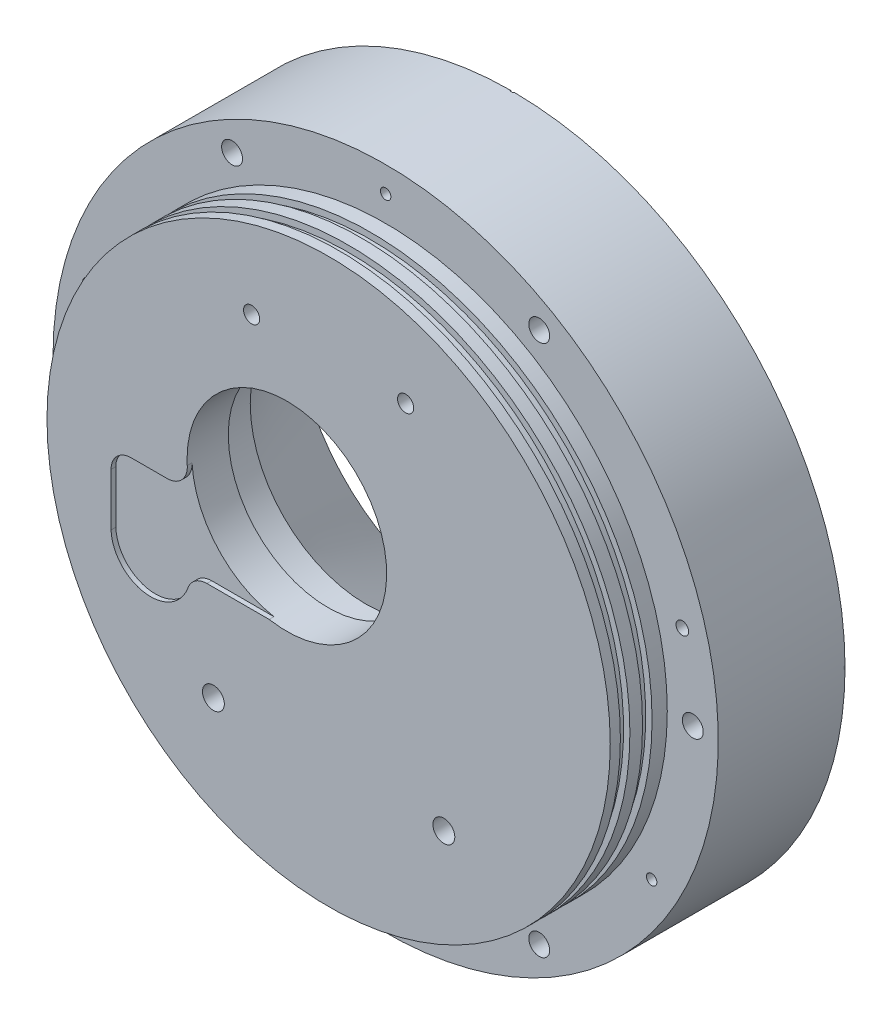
ISO-10303-21;
HEADER;
FILE_DESCRIPTION(('STEP AP214'),'2;1');
FILE_NAME('part.step','',(''),(''),'','','');
FILE_SCHEMA(('AUTOMOTIVE_DESIGN { 1 0 10303 214 1 1 1 1 }'));
ENDSEC;
DATA;
#1=APPLICATION_CONTEXT('core data for automotive mechanical design processes');
#2=APPLICATION_PROTOCOL_DEFINITION('international standard','automotive_design',2000,#1);
#3=PRODUCT_CONTEXT('',#1,'mechanical');
#4=PRODUCT('Part','Part','',(#3));
#5=PRODUCT_RELATED_PRODUCT_CATEGORY('part','',(#4));
#6=PRODUCT_DEFINITION_FORMATION('','',#4);
#7=PRODUCT_DEFINITION_CONTEXT('part definition',#1,'design');
#8=PRODUCT_DEFINITION('design','',#6,#7);
#9=PRODUCT_DEFINITION_SHAPE('','',#8);
#10=(LENGTH_UNIT() NAMED_UNIT(*) SI_UNIT(.MILLI.,.METRE.));
#11=(NAMED_UNIT(*) PLANE_ANGLE_UNIT() SI_UNIT($,.RADIAN.));
#12=(NAMED_UNIT(*) SI_UNIT($,.STERADIAN.) SOLID_ANGLE_UNIT());
#13=UNCERTAINTY_MEASURE_WITH_UNIT(LENGTH_MEASURE(1.E-05),#10,'distance_accuracy_value','');
#14=(GEOMETRIC_REPRESENTATION_CONTEXT(3) GLOBAL_UNCERTAINTY_ASSIGNED_CONTEXT((#13)) GLOBAL_UNIT_ASSIGNED_CONTEXT((#10,
#11,#12)) REPRESENTATION_CONTEXT('',''));
#15=CARTESIAN_POINT('',(0.,0.,0.));
#16=DIRECTION('',(0.,0.,1.));
#17=DIRECTION('',(1.,0.,0.));
#18=AXIS2_PLACEMENT_3D('',#15,#16,#17);
#19=CARTESIAN_POINT('',(13.1763043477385,-11.2500656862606,-4.99999999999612));
#20=DIRECTION('',(0.,0.,-1.));
#21=DIRECTION('',(-1.,0.,0.));
#22=AXIS2_PLACEMENT_3D('',#19,#20,#21);
#23=CYLINDRICAL_SURFACE('',#22,86.9);
#24=CARTESIAN_POINT('',(13.1763043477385,-11.2500656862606,6.80000000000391));
#25=DIRECTION('',(0.,0.,-1.));
#26=DIRECTION('',(-1.,0.,0.));
#27=AXIS2_PLACEMENT_3D('',#24,#25,#26);
#28=CIRCLE('',#27,86.9);
#29=CARTESIAN_POINT('',(-73.7236956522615,-11.2500656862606,6.80000000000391));
#30=VERTEX_POINT('',#29);
#31=EDGE_CURVE('P0_E27',#30,#30,#28,.F.);
#32=ORIENTED_EDGE('',*,*,#31,.T.);
#33=EDGE_LOOP('',(#32));
#34=FACE_BOUND('',#33,.T.);
#35=CARTESIAN_POINT('',(13.1763043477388,-11.2500656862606,9.80000000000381));
#36=DIRECTION('',(0.,0.,-1.));
#37=DIRECTION('',(-1.,0.,0.));
#38=AXIS2_PLACEMENT_3D('',#35,#36,#37);
#39=CIRCLE('',#38,86.9);
#40=CARTESIAN_POINT('',(-73.7236956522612,-11.2500656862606,9.80000000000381));
#41=VERTEX_POINT('',#40);
#42=EDGE_CURVE('P0_E629',#41,#41,#39,.T.);
#43=ORIENTED_EDGE('',*,*,#42,.T.);
#44=EDGE_LOOP('',(#43));
#45=FACE_BOUND('',#44,.T.);
#46=ADVANCED_FACE('P0_F24',(#34,#45),#23,.T.);
#47=CARTESIAN_POINT('',(13.1763043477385,77.6499343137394,6.80000000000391));
#48=DIRECTION('',(0.,0.,-1.));
#49=DIRECTION('',(-1.,0.,0.));
#50=AXIS2_PLACEMENT_3D('',#47,#48,#49);
#51=PLANE('',#50);
#52=ORIENTED_EDGE('',*,*,#31,.F.);
#53=EDGE_LOOP('',(#52));
#54=FACE_BOUND('',#53,.T.);
#55=CARTESIAN_POINT('',(13.1763043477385,-11.2500656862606,6.80000000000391));
#56=DIRECTION('',(0.,0.,1.));
#57=DIRECTION('',(1.,0.,0.));
#58=AXIS2_PLACEMENT_3D('',#55,#56,#57);
#59=CIRCLE('',#58,88.9);
#60=CARTESIAN_POINT('',(102.076304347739,-11.2500656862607,6.80000000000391));
#61=VERTEX_POINT('',#60);
#62=EDGE_CURVE('P0_E381',#61,#61,#59,.F.);
#63=ORIENTED_EDGE('',*,*,#62,.F.);
#64=EDGE_LOOP('',(#63));
#65=FACE_BOUND('',#64,.T.);
#66=ADVANCED_FACE('P0_F1645',(#54,#65),#51,.F.);
#67=CARTESIAN_POINT('',(37.4804092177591,49.5624667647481,-3.51000000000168));
#68=DIRECTION('',(0.,0.,1.));
#69=DIRECTION('',(1.,0.,0.));
#70=AXIS2_PLACEMENT_3D('',#67,#68,#69);
#71=CONICAL_SURFACE('',#70,2.55269999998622,1.02974425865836);
#72=CARTESIAN_POINT('',(37.4804092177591,49.5624667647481,-5.04381690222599));
#73=VERTEX_POINT('',#72);
#74=VERTEX_LOOP('',#73);
#75=FACE_BOUND('',#74,.T.);
#76=CARTESIAN_POINT('',(37.4804092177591,49.5624667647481,-3.50999999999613));
#77=DIRECTION('',(0.,0.,1.));
#78=DIRECTION('',(1.,0.,0.));
#79=AXIS2_PLACEMENT_3D('',#76,#77,#78);
#80=CIRCLE('',#79,2.5527);
#81=CARTESIAN_POINT('',(40.033109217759,49.5624667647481,-3.50999999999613));
#82=VERTEX_POINT('',#81);
#83=EDGE_CURVE('P0_E379',#82,#82,#80,.T.);
#84=ORIENTED_EDGE('',*,*,#83,.T.);
#85=EDGE_LOOP('',(#84));
#86=FACE_BOUND('',#85,.T.);
#87=ADVANCED_FACE('P0_F1638',(#75,#86),#71,.F.);
#88=CARTESIAN_POINT('',(-11.1278005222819,49.5624667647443,-3.50999999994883));
#89=DIRECTION('',(0.,0.,1.));
#90=DIRECTION('',(0.,-1.00000000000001,0.));
#91=AXIS2_PLACEMENT_3D('',#88,#89,#90);
#92=CONICAL_SURFACE('',#91,2.55270000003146,1.02974425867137);
#93=CARTESIAN_POINT('',(-11.1278005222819,49.5624667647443,-5.04381690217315));
#94=VERTEX_POINT('',#93);
#95=VERTEX_LOOP('',#94);
#96=FACE_BOUND('',#95,.T.);
#97=CARTESIAN_POINT('',(-11.1278005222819,49.5624667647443,-3.5099999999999));
#98=DIRECTION('',(0.,0.,1.));
#99=DIRECTION('',(1.,0.,0.));
#100=AXIS2_PLACEMENT_3D('',#97,#98,#99);
#101=CIRCLE('',#100,2.5527);
#102=CARTESIAN_POINT('',(-8.57510052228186,49.5624667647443,-3.5099999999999));
#103=VERTEX_POINT('',#102);
#104=EDGE_CURVE('P0_E376',#103,#103,#101,.T.);
#105=ORIENTED_EDGE('',*,*,#104,.T.);
#106=EDGE_LOOP('',(#105));
#107=FACE_BOUND('',#106,.T.);
#108=ADVANCED_FACE('P0_F1630',(#96,#107),#92,.F.);
#109=CARTESIAN_POINT('',(-23.1964956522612,-61.2242349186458,-6.05300000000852));
#110=DIRECTION('',(0.,0.,1.));
#111=DIRECTION('',(1.,0.,0.));
#112=AXIS2_PLACEMENT_3D('',#109,#110,#111);
#113=CONICAL_SURFACE('',#112,3.45439999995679,1.02974425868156);
#114=CARTESIAN_POINT('',(-23.1964956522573,-61.2242349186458,-8.12861292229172));
#115=VERTEX_POINT('',#114);
#116=VERTEX_LOOP('',#115);
#117=FACE_BOUND('',#116,.T.);
#118=CARTESIAN_POINT('',(-23.1964956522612,-61.2242349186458,-6.05300000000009));
#119=DIRECTION('',(0.,0.,1.));
#120=DIRECTION('',(1.,0.,0.));
#121=AXIS2_PLACEMENT_3D('',#118,#119,#120);
#122=CIRCLE('',#121,3.4544);
#123=CARTESIAN_POINT('',(-19.7420956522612,-61.2242349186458,-6.05300000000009));
#124=VERTEX_POINT('',#123);
#125=EDGE_CURVE('P0_E373',#124,#124,#122,.T.);
#126=ORIENTED_EDGE('',*,*,#125,.T.);
#127=EDGE_LOOP('',(#126));
#128=FACE_BOUND('',#127,.T.);
#129=ADVANCED_FACE('P0_F1623',(#117,#128),#113,.F.);
#130=CARTESIAN_POINT('',(49.5491043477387,-61.224234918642,-6.05299999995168));
#131=DIRECTION('',(0.,0.,1.));
#132=DIRECTION('',(0.,-1.00000000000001,0.));
#133=AXIS2_PLACEMENT_3D('',#130,#131,#132);
#134=CONICAL_SURFACE('',#133,3.45440000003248,1.02974425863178);
#135=CARTESIAN_POINT('',(49.5491043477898,-61.224234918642,-8.12861292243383));
#136=VERTEX_POINT('',#135);
#137=VERTEX_LOOP('',#136);
#138=FACE_BOUND('',#137,.T.);
#139=CARTESIAN_POINT('',(49.5491043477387,-61.224234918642,-6.05299999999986));
#140=DIRECTION('',(0.,0.,1.));
#141=DIRECTION('',(1.,0.,0.));
#142=AXIS2_PLACEMENT_3D('',#139,#140,#141);
#143=CIRCLE('',#142,3.4544);
#144=CARTESIAN_POINT('',(53.0035043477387,-61.224234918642,-6.05299999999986));
#145=VERTEX_POINT('',#144);
#146=EDGE_CURVE('P0_E370',#145,#145,#143,.T.);
#147=ORIENTED_EDGE('',*,*,#146,.T.);
#148=EDGE_LOOP('',(#147));
#149=FACE_BOUND('',#148,.T.);
#150=ADVANCED_FACE('P0_F1615',(#138,#149),#134,.F.);
#151=CARTESIAN_POINT('',(13.1763043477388,77.6499343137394,9.80000000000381));
#152=DIRECTION('',(0.,0.,1.));
#153=DIRECTION('',(1.,0.,0.));
#154=AXIS2_PLACEMENT_3D('',#151,#152,#153);
#155=PLANE('',#154);
#156=CARTESIAN_POINT('',(13.1763043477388,-11.2500656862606,9.80000000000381));
#157=DIRECTION('',(0.,0.,1.));
#158=DIRECTION('',(1.,0.,0.));
#159=AXIS2_PLACEMENT_3D('',#156,#157,#158);
#160=CIRCLE('',#159,88.9);
#161=CARTESIAN_POINT('',(102.076304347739,-11.2500656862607,9.80000000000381));
#162=VERTEX_POINT('',#161);
#163=EDGE_CURVE('P0_E369',#162,#162,#160,.T.);
#164=ORIENTED_EDGE('',*,*,#163,.F.);
#165=EDGE_LOOP('',(#164));
#166=FACE_BOUND('',#165,.T.);
#167=ORIENTED_EDGE('',*,*,#42,.F.);
#168=EDGE_LOOP('',(#167));
#169=FACE_BOUND('',#168,.T.);
#170=ADVANCED_FACE('P0_F1607',(#166,#169),#155,.F.);
#171=CARTESIAN_POINT('',(13.1763043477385,-11.2500656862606,-44.9999999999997));
#172=DIRECTION('',(0.,0.,1.));
#173=DIRECTION('',(1.,0.,0.));
#174=AXIS2_PLACEMENT_3D('',#171,#172,#173);
#175=CYLINDRICAL_SURFACE('',#174,88.9);
#176=CARTESIAN_POINT('',(13.1763043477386,-11.2500656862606,2.80000000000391));
#177=DIRECTION('',(0.,0.,1.));
#178=DIRECTION('',(1.,0.,0.));
#179=AXIS2_PLACEMENT_3D('',#176,#177,#178);
#180=CIRCLE('',#179,88.9);
#181=CARTESIAN_POINT('',(102.076304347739,-11.2500656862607,2.80000000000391));
#182=VERTEX_POINT('',#181);
#183=EDGE_CURVE('P0_E353',#182,#182,#180,.T.);
#184=ORIENTED_EDGE('',*,*,#183,.T.);
#185=EDGE_LOOP('',(#184));
#186=FACE_BOUND('',#185,.T.);
#187=ORIENTED_EDGE('',*,*,#62,.T.);
#188=EDGE_LOOP('',(#187));
#189=FACE_BOUND('',#188,.T.);
#190=ADVANCED_FACE('P0_F1599',(#186,#189),#175,.T.);
#191=CARTESIAN_POINT('',(37.4804092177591,49.5624667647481,13.0000000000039));
#192=DIRECTION('',(0.,0.,1.));
#193=DIRECTION('',(1.,0.,0.));
#194=AXIS2_PLACEMENT_3D('',#191,#192,#193);
#195=CYLINDRICAL_SURFACE('',#194,2.5527);
#196=ORIENTED_EDGE('',*,*,#83,.F.);
#197=EDGE_LOOP('',(#196));
#198=FACE_BOUND('',#197,.T.);
#199=CARTESIAN_POINT('',(37.4804092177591,49.5624667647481,13.0000000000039));
#200=DIRECTION('',(0.,0.,1.));
#201=DIRECTION('',(1.,0.,0.));
#202=AXIS2_PLACEMENT_3D('',#199,#200,#201);
#203=CIRCLE('',#202,2.5527);
#204=CARTESIAN_POINT('',(40.0331092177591,49.5624667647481,13.0000000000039));
#205=VERTEX_POINT('',#204);
#206=EDGE_CURVE('P0_E340',#205,#205,#203,.T.);
#207=ORIENTED_EDGE('',*,*,#206,.T.);
#208=EDGE_LOOP('',(#207));
#209=FACE_BOUND('',#208,.T.);
#210=ADVANCED_FACE('P0_F1591',(#198,#209),#195,.F.);
#211=CARTESIAN_POINT('',(-11.1278005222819,49.5624667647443,13.0000000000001));
#212=DIRECTION('',(0.,0.,1.));
#213=DIRECTION('',(1.,0.,0.));
#214=AXIS2_PLACEMENT_3D('',#211,#212,#213);
#215=CYLINDRICAL_SURFACE('',#214,2.5527);
#216=ORIENTED_EDGE('',*,*,#104,.F.);
#217=EDGE_LOOP('',(#216));
#218=FACE_BOUND('',#217,.T.);
#219=CARTESIAN_POINT('',(-11.1278005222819,49.5624667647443,13.0000000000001));
#220=DIRECTION('',(0.,0.,1.));
#221=DIRECTION('',(1.,0.,0.));
#222=AXIS2_PLACEMENT_3D('',#219,#220,#221);
#223=CIRCLE('',#222,2.5527);
#224=CARTESIAN_POINT('',(-8.57510052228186,49.5624667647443,13.0000000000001));
#225=VERTEX_POINT('',#224);
#226=EDGE_CURVE('P0_E612',#225,#225,#223,.T.);
#227=ORIENTED_EDGE('',*,*,#226,.T.);
#228=EDGE_LOOP('',(#227));
#229=FACE_BOUND('',#228,.T.);
#230=ADVANCED_FACE('P0_F1583',(#218,#229),#215,.F.);
#231=CARTESIAN_POINT('',(-23.1964956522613,-61.2242349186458,12.9999999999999));
#232=DIRECTION('',(0.,0.,1.));
#233=DIRECTION('',(1.,0.,0.));
#234=AXIS2_PLACEMENT_3D('',#231,#232,#233);
#235=CYLINDRICAL_SURFACE('',#234,3.4544);
#236=ORIENTED_EDGE('',*,*,#125,.F.);
#237=EDGE_LOOP('',(#236));
#238=FACE_BOUND('',#237,.T.);
#239=CARTESIAN_POINT('',(-23.1964956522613,-61.2242349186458,12.9999999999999));
#240=DIRECTION('',(0.,0.,1.));
#241=DIRECTION('',(1.,0.,0.));
#242=AXIS2_PLACEMENT_3D('',#239,#240,#241);
#243=CIRCLE('',#242,3.4544);
#244=CARTESIAN_POINT('',(-19.7420956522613,-61.2242349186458,12.9999999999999));
#245=VERTEX_POINT('',#244);
#246=EDGE_CURVE('P0_E609',#245,#245,#243,.T.);
#247=ORIENTED_EDGE('',*,*,#246,.T.);
#248=EDGE_LOOP('',(#247));
#249=FACE_BOUND('',#248,.T.);
#250=ADVANCED_FACE('P0_F1575',(#238,#249),#235,.F.);
#251=CARTESIAN_POINT('',(49.5491043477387,-61.224234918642,13.0000000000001));
#252=DIRECTION('',(0.,0.,1.));
#253=DIRECTION('',(1.,0.,0.));
#254=AXIS2_PLACEMENT_3D('',#251,#252,#253);
#255=CYLINDRICAL_SURFACE('',#254,3.4544);
#256=ORIENTED_EDGE('',*,*,#146,.F.);
#257=EDGE_LOOP('',(#256));
#258=FACE_BOUND('',#257,.T.);
#259=CARTESIAN_POINT('',(49.5491043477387,-61.224234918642,13.0000000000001));
#260=DIRECTION('',(0.,0.,1.));
#261=DIRECTION('',(1.,0.,0.));
#262=AXIS2_PLACEMENT_3D('',#259,#260,#261);
#263=CIRCLE('',#262,3.4544);
#264=CARTESIAN_POINT('',(53.0035043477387,-61.224234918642,13.0000000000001));
#265=VERTEX_POINT('',#264);
#266=EDGE_CURVE('P0_E606',#265,#265,#263,.T.);
#267=ORIENTED_EDGE('',*,*,#266,.T.);
#268=EDGE_LOOP('',(#267));
#269=FACE_BOUND('',#268,.T.);
#270=ADVANCED_FACE('P0_F1567',(#258,#269),#255,.F.);
#271=CARTESIAN_POINT('',(13.1763043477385,-11.2500656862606,-44.9999999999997));
#272=DIRECTION('',(0.,0.,1.));
#273=DIRECTION('',(1.,0.,0.));
#274=AXIS2_PLACEMENT_3D('',#271,#272,#273);
#275=CYLINDRICAL_SURFACE('',#274,88.9);
#276=ORIENTED_EDGE('',*,*,#163,.T.);
#277=EDGE_LOOP('',(#276));
#278=FACE_BOUND('',#277,.T.);
#279=CARTESIAN_POINT('',(13.1763043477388,-11.2500656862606,13.0000000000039));
#280=DIRECTION('',(0.,0.,1.));
#281=DIRECTION('',(1.,0.,0.));
#282=AXIS2_PLACEMENT_3D('',#279,#280,#281);
#283=CIRCLE('',#282,88.9);
#284=CARTESIAN_POINT('',(102.076304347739,-11.2500656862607,13.0000000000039));
#285=VERTEX_POINT('',#284);
#286=EDGE_CURVE('P0_E603',#285,#285,#283,.F.);
#287=ORIENTED_EDGE('',*,*,#286,.T.);
#288=EDGE_LOOP('',(#287));
#289=FACE_BOUND('',#288,.T.);
#290=ADVANCED_FACE('P0_F1560',(#278,#289),#275,.T.);
#291=CARTESIAN_POINT('',(-37.7834881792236,-2.24288229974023,13.0000000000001));
#292=DIRECTION('',(0.,0.,-1.));
#293=DIRECTION('',(-1.,0.,0.));
#294=AXIS2_PLACEMENT_3D('',#291,#292,#293);
#295=CYLINDRICAL_SURFACE('',#294,6.35);
#296=CARTESIAN_POINT('',(-37.7834881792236,-2.24288229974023,13.0000000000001));
#297=DIRECTION('',(0.,0.,-1.));
#298=DIRECTION('',(-1.,0.,0.));
#299=AXIS2_PLACEMENT_3D('',#296,#297,#298);
#300=CIRCLE('',#299,6.35);
#301=CARTESIAN_POINT('',(-31.4446467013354,-1.86659953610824,13.0000000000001));
#302=VERTEX_POINT('',#301);
#303=CARTESIAN_POINT('',(-37.7834881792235,-8.59288229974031,13.0000000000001));
#304=VERTEX_POINT('',#303);
#305=EDGE_CURVE('P0_E337',#302,#304,#300,.T.);
#306=ORIENTED_EDGE('',*,*,#305,.T.);
#307=DIRECTION('',(0.,0.,1.));
#308=VECTOR('',#307,1.);
#309=CARTESIAN_POINT('',(-37.7834881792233,-8.59288229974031,11.5000000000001));
#310=LINE('',#309,#308);
#311=CARTESIAN_POINT('',(-37.7834881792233,-8.59288229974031,11.5000000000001));
#312=VERTEX_POINT('',#311);
#313=EDGE_CURVE('P0_E259',#304,#312,#310,.F.);
#314=ORIENTED_EDGE('',*,*,#313,.T.);
#315=CARTESIAN_POINT('',(-37.7834881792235,-2.24288229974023,11.5000000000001));
#316=DIRECTION('',(0.,0.,-1.));
#317=DIRECTION('',(-1.,0.,0.));
#318=AXIS2_PLACEMENT_3D('',#315,#316,#317);
#319=CIRCLE('',#318,6.35);
#320=CARTESIAN_POINT('',(-31.4446467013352,-1.86659953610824,11.5000000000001));
#321=VERTEX_POINT('',#320);
#322=EDGE_CURVE('P0_E350',#312,#321,#319,.F.);
#323=ORIENTED_EDGE('',*,*,#322,.T.);
#324=DIRECTION('',(0.,0.,-1.));
#325=VECTOR('',#324,1.);
#326=CARTESIAN_POINT('',(-31.4446467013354,-1.86659953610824,13.0000000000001));
#327=LINE('',#326,#325);
#328=EDGE_CURVE('P0_E366',#321,#302,#327,.F.);
#329=ORIENTED_EDGE('',*,*,#328,.T.);
#330=EDGE_LOOP('',(#306,#314,#323,#329));
#331=FACE_BOUND('',#330,.T.);
#332=ADVANCED_FACE('P0_F1552',(#331),#295,.T.);
#333=CARTESIAN_POINT('',(-55.4999999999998,-8.59288229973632,11.5000000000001));
#334=DIRECTION('',(0.,1.00000000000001,0.));
#335=DIRECTION('',(0.,0.,1.));
#336=AXIS2_PLACEMENT_3D('',#333,#334,#335);
#337=PLANE('',#336);
#338=ORIENTED_EDGE('',*,*,#313,.F.);
#339=DIRECTION('',(-1.,0.,0.));
#340=VECTOR('',#339,1.);
#341=CARTESIAN_POINT('',(13.1763043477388,-8.59288229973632,13.0000000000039));
#342=LINE('',#341,#340);
#343=CARTESIAN_POINT('',(-49.1499999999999,-8.59288229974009,13.0000000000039));
#344=VERTEX_POINT('',#343);
#345=EDGE_CURVE('P0_E335',#304,#344,#342,.T.);
#346=ORIENTED_EDGE('',*,*,#345,.T.);
#347=DIRECTION('',(0.,0.,-1.));
#348=VECTOR('',#347,1.);
#349=CARTESIAN_POINT('',(-49.1499999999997,-8.59288229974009,11.5000000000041));
#350=LINE('',#349,#348);
#351=CARTESIAN_POINT('',(-49.1499999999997,-8.59288229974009,11.5000000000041));
#352=VERTEX_POINT('',#351);
#353=EDGE_CURVE('P0_E363',#344,#352,#350,.T.);
#354=ORIENTED_EDGE('',*,*,#353,.T.);
#355=DIRECTION('',(-1.,0.,0.));
#356=VECTOR('',#355,1.);
#357=CARTESIAN_POINT('',(-43.0051152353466,-8.59288229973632,11.5000000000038));
#358=LINE('',#357,#356);
#359=EDGE_CURVE('P0_E338',#352,#312,#358,.F.);
#360=ORIENTED_EDGE('',*,*,#359,.T.);
#361=EDGE_LOOP('',(#338,#346,#354,#360));
#362=FACE_BOUND('',#361,.T.);
#363=ADVANCED_FACE('P0_F1544',(#362),#337,.F.);
#364=CARTESIAN_POINT('',(-49.1499999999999,-14.9428822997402,11.5000000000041));
#365=DIRECTION('',(0.,0.,-1.));
#366=DIRECTION('',(-1.,0.,0.));
#367=AXIS2_PLACEMENT_3D('',#364,#365,#366);
#368=CYLINDRICAL_SURFACE('',#367,6.35);
#369=ORIENTED_EDGE('',*,*,#353,.F.);
#370=CARTESIAN_POINT('',(-49.15,-14.9428822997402,13.0000000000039));
#371=DIRECTION('',(0.,0.,-1.));
#372=DIRECTION('',(-1.,0.,0.));
#373=AXIS2_PLACEMENT_3D('',#370,#371,#372);
#374=CIRCLE('',#373,6.35);
#375=CARTESIAN_POINT('',(-55.5,-14.9428822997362,13.0000000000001));
#376=VERTEX_POINT('',#375);
#377=EDGE_CURVE('P0_E334',#344,#376,#374,.F.);
#378=ORIENTED_EDGE('',*,*,#377,.T.);
#379=DIRECTION('',(0.,0.,1.));
#380=VECTOR('',#379,1.);
#381=CARTESIAN_POINT('',(-55.4999999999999,-14.9428822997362,11.5000000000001));
#382=LINE('',#381,#380);
#383=CARTESIAN_POINT('',(-55.4999999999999,-14.9428822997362,11.5000000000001));
#384=VERTEX_POINT('',#383);
#385=EDGE_CURVE('P0_E361',#376,#384,#382,.F.);
#386=ORIENTED_EDGE('',*,*,#385,.T.);
#387=CARTESIAN_POINT('',(-49.1499999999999,-14.9428822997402,11.5000000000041));
#388=DIRECTION('',(0.,0.,-1.));
#389=DIRECTION('',(-1.,0.,0.));
#390=AXIS2_PLACEMENT_3D('',#387,#388,#389);
#391=CIRCLE('',#390,6.35);
#392=EDGE_CURVE('P0_E341',#384,#352,#391,.T.);
#393=ORIENTED_EDGE('',*,*,#392,.T.);
#394=EDGE_LOOP('',(#369,#378,#386,#393));
#395=FACE_BOUND('',#394,.T.);
#396=ADVANCED_FACE('P0_F1536',(#395),#368,.F.);
#397=CARTESIAN_POINT('',(-55.4999999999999,-30.9999999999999,11.5000000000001));
#398=DIRECTION('',(-1.,0.,0.));
#399=DIRECTION('',(0.,0.,1.));
#400=AXIS2_PLACEMENT_3D('',#397,#398,#399);
#401=PLANE('',#400);
#402=ORIENTED_EDGE('',*,*,#385,.F.);
#403=DIRECTION('',(0.,1.00000000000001,0.));
#404=VECTOR('',#403,1.);
#405=CARTESIAN_POINT('',(-55.4999999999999,-11.2500656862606,13.0000000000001));
#406=LINE('',#405,#404);
#407=CARTESIAN_POINT('',(-55.5,-31.5000000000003,13.0000000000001));
#408=VERTEX_POINT('',#407);
#409=EDGE_CURVE('P0_E330',#376,#408,#406,.F.);
#410=ORIENTED_EDGE('',*,*,#409,.T.);
#411=DIRECTION('',(0.,0.,1.));
#412=VECTOR('',#411,1.);
#413=CARTESIAN_POINT('',(-55.4999999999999,-31.5000000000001,11.5000000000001));
#414=LINE('',#413,#412);
#415=CARTESIAN_POINT('',(-55.4999999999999,-31.5000000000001,11.5000000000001));
#416=VERTEX_POINT('',#415);
#417=EDGE_CURVE('P0_E359',#408,#416,#414,.F.);
#418=ORIENTED_EDGE('',*,*,#417,.T.);
#419=DIRECTION('',(0.,1.00000000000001,0.));
#420=VECTOR('',#419,1.);
#421=CARTESIAN_POINT('',(-55.4999999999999,-30.9942382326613,11.5000000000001));
#422=LINE('',#421,#420);
#423=EDGE_CURVE('P0_E342',#416,#384,#422,.T.);
#424=ORIENTED_EDGE('',*,*,#423,.T.);
#425=EDGE_LOOP('',(#402,#410,#418,#424));
#426=FACE_BOUND('',#425,.T.);
#427=ADVANCED_FACE('P0_F1528',(#426),#401,.F.);
#428=CARTESIAN_POINT('',(-43.0051152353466,-30.9942382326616,11.5000000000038));
#429=DIRECTION('',(0.,0.,1.));
#430=DIRECTION('',(1.,0.,0.));
#431=AXIS2_PLACEMENT_3D('',#428,#429,#430);
#432=CYLINDRICAL_SURFACE('',#431,12.505116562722);
#433=DIRECTION('',(0.,0.,1.));
#434=VECTOR('',#433,1.);
#435=CARTESIAN_POINT('',(-31.2318667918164,-35.2095153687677,11.5000000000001));
#436=LINE('',#435,#434);
#437=CARTESIAN_POINT('',(-31.2318667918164,-35.2095153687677,11.5000000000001));
#438=VERTEX_POINT('',#437);
#439=CARTESIAN_POINT('',(-31.2318667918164,-35.2095153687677,13.0000000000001));
#440=VERTEX_POINT('',#439);
#441=EDGE_CURVE('P0_E356',#438,#440,#436,.T.);
#442=ORIENTED_EDGE('',*,*,#441,.F.);
#443=CARTESIAN_POINT('',(-43.0051152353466,-30.9942382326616,11.5000000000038));
#444=DIRECTION('',(0.,0.,1.));
#445=DIRECTION('',(1.,0.,0.));
#446=AXIS2_PLACEMENT_3D('',#443,#444,#445);
#447=CIRCLE('',#446,12.505116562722);
#448=EDGE_CURVE('P0_E345',#438,#416,#447,.F.);
#449=ORIENTED_EDGE('',*,*,#448,.T.);
#450=ORIENTED_EDGE('',*,*,#417,.F.);
#451=CARTESIAN_POINT('',(-43.0051152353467,-30.9942382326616,13.0000000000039));
#452=DIRECTION('',(0.,0.,-1.));
#453=DIRECTION('',(-1.,0.,0.));
#454=AXIS2_PLACEMENT_3D('',#451,#452,#453);
#455=CIRCLE('',#454,12.505116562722);
#456=EDGE_CURVE('P0_E333',#408,#440,#455,.F.);
#457=ORIENTED_EDGE('',*,*,#456,.T.);
#458=EDGE_LOOP('',(#442,#449,#450,#457));
#459=FACE_BOUND('',#458,.T.);
#460=ADVANCED_FACE('P0_F1520',(#459),#432,.F.);
#461=CARTESIAN_POINT('',(-25.2535036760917,-37.350000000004,11.5000000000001));
#462=DIRECTION('',(0.,0.,1.));
#463=DIRECTION('',(1.,0.,0.));
#464=AXIS2_PLACEMENT_3D('',#461,#462,#463);
#465=CYLINDRICAL_SURFACE('',#464,6.35);
#466=CARTESIAN_POINT('',(-25.2535036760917,-37.350000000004,12.9999999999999));
#467=DIRECTION('',(0.,0.,-1.));
#468=DIRECTION('',(-1.,0.,0.));
#469=AXIS2_PLACEMENT_3D('',#466,#467,#468);
#470=CIRCLE('',#469,6.35);
#471=CARTESIAN_POINT('',(-25.2535036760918,-31.0000000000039,12.9999999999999));
#472=VERTEX_POINT('',#471);
#473=EDGE_CURVE('P0_E329',#440,#472,#470,.T.);
#474=ORIENTED_EDGE('',*,*,#473,.T.);
#475=DIRECTION('',(0.,0.,-1.));
#476=VECTOR('',#475,1.);
#477=CARTESIAN_POINT('',(-25.2535036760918,-31.0000000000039,11.5000000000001));
#478=LINE('',#477,#476);
#479=CARTESIAN_POINT('',(-25.2535036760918,-31.0000000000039,11.5000000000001));
#480=VERTEX_POINT('',#479);
#481=EDGE_CURVE('P0_E351',#472,#480,#478,.T.);
#482=ORIENTED_EDGE('',*,*,#481,.T.);
#483=CARTESIAN_POINT('',(-25.2535036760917,-37.350000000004,11.5000000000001));
#484=DIRECTION('',(0.,0.,1.));
#485=DIRECTION('',(1.,0.,0.));
#486=AXIS2_PLACEMENT_3D('',#483,#484,#485);
#487=CIRCLE('',#486,6.35);
#488=EDGE_CURVE('P0_E349',#480,#438,#487,.T.);
#489=ORIENTED_EDGE('',*,*,#488,.T.);
#490=ORIENTED_EDGE('',*,*,#441,.T.);
#491=EDGE_LOOP('',(#474,#482,#489,#490));
#492=FACE_BOUND('',#491,.T.);
#493=ADVANCED_FACE('P0_F1512',(#492),#465,.T.);
#494=CARTESIAN_POINT('',(-5.59016994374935,-31.0000000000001,11.5000000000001));
#495=DIRECTION('',(0.,-1.00000000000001,0.));
#496=DIRECTION('',(0.,0.,-1.));
#497=AXIS2_PLACEMENT_3D('',#494,#495,#496);
#498=PLANE('',#497);
#499=ORIENTED_EDGE('',*,*,#481,.F.);
#500=DIRECTION('',(-1.,0.,0.));
#501=VECTOR('',#500,1.);
#502=CARTESIAN_POINT('',(13.1763043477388,-30.9999999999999,13.0000000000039));
#503=LINE('',#502,#501);
#504=CARTESIAN_POINT('',(-5.59016994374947,-31.0000000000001,13.0000000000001));
#505=VERTEX_POINT('',#504);
#506=EDGE_CURVE('P0_E325',#472,#505,#503,.F.);
#507=ORIENTED_EDGE('',*,*,#506,.T.);
#508=DIRECTION('',(0.,0.,-1.));
#509=VECTOR('',#508,1.);
#510=CARTESIAN_POINT('',(-5.59016994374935,-31.0000000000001,11.5000000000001));
#511=LINE('',#510,#509);
#512=CARTESIAN_POINT('',(-5.59016994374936,-31.0000000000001,11.5000000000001));
#513=VERTEX_POINT('',#512);
#514=EDGE_CURVE('P0_E354',#513,#505,#511,.F.);
#515=ORIENTED_EDGE('',*,*,#514,.F.);
#516=DIRECTION('',(-1.,0.,0.));
#517=VECTOR('',#516,1.);
#518=CARTESIAN_POINT('',(-43.0051152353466,-30.9999999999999,11.5000000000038));
#519=LINE('',#518,#517);
#520=EDGE_CURVE('P0_E346',#513,#480,#519,.T.);
#521=ORIENTED_EDGE('',*,*,#520,.T.);
#522=EDGE_LOOP('',(#499,#507,#515,#521));
#523=FACE_BOUND('',#522,.T.);
#524=ADVANCED_FACE('P0_F1504',(#523),#498,.F.);
#525=CARTESIAN_POINT('',(13.1763043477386,77.6499343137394,2.80000000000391));
#526=DIRECTION('',(0.,0.,1.));
#527=DIRECTION('',(1.,0.,0.));
#528=AXIS2_PLACEMENT_3D('',#525,#526,#527);
#529=PLANE('',#528);
#530=ORIENTED_EDGE('',*,*,#183,.F.);
#531=EDGE_LOOP('',(#530));
#532=FACE_BOUND('',#531,.T.);
#533=CARTESIAN_POINT('',(13.1763043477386,-11.2500656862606,2.80000000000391));
#534=DIRECTION('',(0.,0.,-1.));
#535=DIRECTION('',(-1.,0.,0.));
#536=AXIS2_PLACEMENT_3D('',#533,#534,#535);
#537=CIRCLE('',#536,86.9);
#538=CARTESIAN_POINT('',(-73.7236956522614,-11.2500656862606,2.80000000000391));
#539=VERTEX_POINT('',#538);
#540=EDGE_CURVE('P0_E328',#539,#539,#537,.T.);
#541=ORIENTED_EDGE('',*,*,#540,.F.);
#542=EDGE_LOOP('',(#541));
#543=FACE_BOUND('',#542,.T.);
#544=ADVANCED_FACE('P0_F1496',(#532,#543),#529,.F.);
#545=CARTESIAN_POINT('',(-43.0051152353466,-30.9942382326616,11.5000000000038));
#546=DIRECTION('',(0.,0.,-1.));
#547=DIRECTION('',(-1.,0.,0.));
#548=AXIS2_PLACEMENT_3D('',#545,#546,#547);
#549=PLANE('',#548);
#550=ORIENTED_EDGE('',*,*,#392,.F.);
#551=ORIENTED_EDGE('',*,*,#423,.F.);
#552=ORIENTED_EDGE('',*,*,#448,.F.);
#553=ORIENTED_EDGE('',*,*,#488,.F.);
#554=ORIENTED_EDGE('',*,*,#520,.F.);
#555=CARTESIAN_POINT('',(2.4980018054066E-13,0.,11.5000000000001));
#556=DIRECTION('',(0.,0.,-1.));
#557=DIRECTION('',(-1.,0.,0.));
#558=AXIS2_PLACEMENT_3D('',#555,#556,#557);
#559=CIRCLE('',#558,31.5);
#560=EDGE_CURVE('P0_E594',#513,#321,#559,.T.);
#561=ORIENTED_EDGE('',*,*,#560,.T.);
#562=ORIENTED_EDGE('',*,*,#322,.F.);
#563=ORIENTED_EDGE('',*,*,#359,.F.);
#564=EDGE_LOOP('',(#550,#551,#552,#553,#554,#561,#562,#563));
#565=FACE_BOUND('',#564,.T.);
#566=ADVANCED_FACE('P0_F1488',(#565),#549,.F.);
#567=CARTESIAN_POINT('',(13.1763043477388,-11.2500656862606,13.0000000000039));
#568=DIRECTION('',(0.,0.,-1.));
#569=DIRECTION('',(-1.,0.,0.));
#570=AXIS2_PLACEMENT_3D('',#567,#568,#569);
#571=PLANE('',#570);
#572=ORIENTED_EDGE('',*,*,#473,.F.);
#573=ORIENTED_EDGE('',*,*,#456,.F.);
#574=ORIENTED_EDGE('',*,*,#409,.F.);
#575=ORIENTED_EDGE('',*,*,#377,.F.);
#576=ORIENTED_EDGE('',*,*,#345,.F.);
#577=ORIENTED_EDGE('',*,*,#305,.F.);
#578=CARTESIAN_POINT('',(2.4980018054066E-13,0.,12.9999999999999));
#579=DIRECTION('',(0.,0.,-1.));
#580=DIRECTION('',(-1.,0.,0.));
#581=AXIS2_PLACEMENT_3D('',#578,#579,#580);
#582=CIRCLE('',#581,31.5);
#583=EDGE_CURVE('P0_E591',#302,#505,#582,.T.);
#584=ORIENTED_EDGE('',*,*,#583,.T.);
#585=ORIENTED_EDGE('',*,*,#506,.F.);
#586=EDGE_LOOP('',(#572,#573,#574,#575,#576,#577,#584,#585));
#587=FACE_BOUND('',#586,.T.);
#588=ORIENTED_EDGE('',*,*,#286,.F.);
#589=EDGE_LOOP('',(#588));
#590=FACE_BOUND('',#589,.T.);
#591=ORIENTED_EDGE('',*,*,#266,.F.);
#592=EDGE_LOOP('',(#591));
#593=FACE_BOUND('',#592,.T.);
#594=ORIENTED_EDGE('',*,*,#246,.F.);
#595=EDGE_LOOP('',(#594));
#596=FACE_BOUND('',#595,.T.);
#597=ORIENTED_EDGE('',*,*,#226,.F.);
#598=EDGE_LOOP('',(#597));
#599=FACE_BOUND('',#598,.T.);
#600=ORIENTED_EDGE('',*,*,#206,.F.);
#601=EDGE_LOOP('',(#600));
#602=FACE_BOUND('',#601,.T.);
#603=ADVANCED_FACE('P0_F1480',(#587,#590,#593,#596,#599,#602),#571,.F.);
#604=CARTESIAN_POINT('',(13.1763043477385,-11.2500656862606,-4.99999999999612));
#605=DIRECTION('',(0.,0.,-1.));
#606=DIRECTION('',(-1.,0.,0.));
#607=AXIS2_PLACEMENT_3D('',#604,#605,#606);
#608=CYLINDRICAL_SURFACE('',#607,86.9);
#609=CARTESIAN_POINT('',(13.1763043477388,-11.2500656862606,-0.199999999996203));
#610=DIRECTION('',(0.,0.,-1.));
#611=DIRECTION('',(-1.,0.,0.));
#612=AXIS2_PLACEMENT_3D('',#609,#610,#611);
#613=CIRCLE('',#612,86.9);
#614=CARTESIAN_POINT('',(-73.7236956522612,-11.2500656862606,-0.199999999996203));
#615=VERTEX_POINT('',#614);
#616=EDGE_CURVE('P0_E321',#615,#615,#613,.F.);
#617=ORIENTED_EDGE('',*,*,#616,.T.);
#618=EDGE_LOOP('',(#617));
#619=FACE_BOUND('',#618,.T.);
#620=ORIENTED_EDGE('',*,*,#540,.T.);
#621=EDGE_LOOP('',(#620));
#622=FACE_BOUND('',#621,.T.);
#623=ADVANCED_FACE('P0_F1472',(#619,#622),#608,.T.);
#624=CARTESIAN_POINT('',(2.4980018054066E-13,0.,12.9999999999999));
#625=DIRECTION('',(0.,0.,-1.));
#626=DIRECTION('',(-1.,0.,0.));
#627=AXIS2_PLACEMENT_3D('',#624,#625,#626);
#628=CYLINDRICAL_SURFACE('',#627,31.5);
#629=CARTESIAN_POINT('',(0.,0.,0.));
#630=DIRECTION('',(0.,0.,-1.));
#631=DIRECTION('',(-1.,0.,0.));
#632=AXIS2_PLACEMENT_3D('',#629,#630,#631);
#633=CIRCLE('',#632,31.5);
#634=CARTESIAN_POINT('',(-31.5,0.,0.));
#635=VERTEX_POINT('',#634);
#636=EDGE_CURVE('P0_E315',#635,#635,#633,.T.);
#637=ORIENTED_EDGE('',*,*,#636,.T.);
#638=EDGE_LOOP('',(#637));
#639=FACE_BOUND('',#638,.T.);
#640=ORIENTED_EDGE('',*,*,#583,.F.);
#641=ORIENTED_EDGE('',*,*,#328,.F.);
#642=ORIENTED_EDGE('',*,*,#560,.F.);
#643=ORIENTED_EDGE('',*,*,#514,.T.);
#644=EDGE_LOOP('',(#640,#641,#642,#643));
#645=FACE_BOUND('',#644,.T.);
#646=ADVANCED_FACE('P0_F308',(#639,#645),#628,.F.);
#647=CARTESIAN_POINT('',(-80.4702045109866,13.842440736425,-11.0000000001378));
#648=DIRECTION('',(0.,0.,1.));
#649=DIRECTION('',(1.,0.,0.));
#650=AXIS2_PLACEMENT_3D('',#647,#648,#649);
#651=CONICAL_SURFACE('',#650,1.99999999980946,1.02974425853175);
#652=CARTESIAN_POINT('',(-80.4702045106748,13.842440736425,-12.2017212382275));
#653=VERTEX_POINT('',#652);
#654=VERTEX_LOOP('',#653);
#655=FACE_BOUND('',#654,.T.);
#656=CARTESIAN_POINT('',(-80.4702045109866,13.842440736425,-10.9999999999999));
#657=DIRECTION('',(0.,0.,1.));
#658=DIRECTION('',(1.,0.,0.));
#659=AXIS2_PLACEMENT_3D('',#656,#657,#658);
#660=CIRCLE('',#659,2.);
#661=CARTESIAN_POINT('',(-78.4702045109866,13.842440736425,-10.9999999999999));
#662=VERTEX_POINT('',#661);
#663=EDGE_CURVE('P0_E312',#662,#662,#660,.T.);
#664=ORIENTED_EDGE('',*,*,#663,.T.);
#665=EDGE_LOOP('',(#664));
#666=FACE_BOUND('',#665,.T.);
#667=ADVANCED_FACE('P0_F304',(#655,#666),#651,.F.);
#668=CARTESIAN_POINT('',(106.822813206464,13.8424407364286,-11.0000000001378));
#669=DIRECTION('',(0.,0.,1.));
#670=DIRECTION('',(1.,0.,0.));
#671=AXIS2_PLACEMENT_3D('',#668,#669,#670);
#672=CONICAL_SURFACE('',#671,1.99999999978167,1.02974425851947);
#673=CARTESIAN_POINT('',(106.822813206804,13.8424407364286,-12.2017212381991));
#674=VERTEX_POINT('',#673);
#675=VERTEX_LOOP('',#674);
#676=FACE_BOUND('',#675,.T.);
#677=CARTESIAN_POINT('',(106.822813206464,13.8424407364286,-10.9999999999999));
#678=DIRECTION('',(0.,0.,1.));
#679=DIRECTION('',(1.,0.,0.));
#680=AXIS2_PLACEMENT_3D('',#677,#678,#679);
#681=CIRCLE('',#680,2.);
#682=CARTESIAN_POINT('',(108.822813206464,13.8424407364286,-10.9999999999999));
#683=VERTEX_POINT('',#682);
#684=EDGE_CURVE('P0_E314',#683,#683,#681,.T.);
#685=ORIENTED_EDGE('',*,*,#684,.T.);
#686=EDGE_LOOP('',(#685));
#687=FACE_BOUND('',#686,.T.);
#688=ADVANCED_FACE('P0_F307',(#676,#687),#672,.F.);
#689=CARTESIAN_POINT('',(13.1763043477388,77.6499343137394,-0.199999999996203));
#690=DIRECTION('',(0.,0.,-1.));
#691=DIRECTION('',(-1.,0.,0.));
#692=AXIS2_PLACEMENT_3D('',#689,#690,#691);
#693=PLANE('',#692);
#694=ORIENTED_EDGE('',*,*,#616,.F.);
#695=EDGE_LOOP('',(#694));
#696=FACE_BOUND('',#695,.T.);
#697=CARTESIAN_POINT('',(13.1763043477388,-11.2500656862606,-0.199999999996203));
#698=DIRECTION('',(0.,0.,1.));
#699=DIRECTION('',(1.,0.,0.));
#700=AXIS2_PLACEMENT_3D('',#697,#698,#699);
#701=CIRCLE('',#700,88.9);
#702=CARTESIAN_POINT('',(102.076304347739,-11.2500656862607,-0.199999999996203));
#703=VERTEX_POINT('',#702);
#704=EDGE_CURVE('P0_E318',#703,#703,#701,.F.);
#705=ORIENTED_EDGE('',*,*,#704,.F.);
#706=EDGE_LOOP('',(#705));
#707=FACE_BOUND('',#706,.T.);
#708=ADVANCED_FACE('P0_F1447',(#696,#707),#693,.F.);
#709=CARTESIAN_POINT('',(-23.8236956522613,-77.2500656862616,-36.));
#710=DIRECTION('',(0.,-1.00000000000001,0.));
#711=DIRECTION('',(0.,0.,-1.));
#712=AXIS2_PLACEMENT_3D('',#709,#710,#711);
#713=CONICAL_SURFACE('',#712,3.49999999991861,1.02974425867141);
#714=CARTESIAN_POINT('',(-23.8236956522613,-75.1470535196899,-36.));
#715=VERTEX_POINT('',#714);
#716=VERTEX_LOOP('',#715);
#717=FACE_BOUND('',#716,.T.);
#718=CARTESIAN_POINT('',(-23.8236956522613,-77.2500656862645,-36.));
#719=DIRECTION('',(0.,-1.00000000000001,0.));
#720=DIRECTION('',(0.,0.,-1.));
#721=AXIS2_PLACEMENT_3D('',#718,#719,#720);
#722=CIRCLE('',#721,3.5);
#723=CARTESIAN_POINT('',(-23.8236956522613,-77.2500656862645,-39.5));
#724=VERTEX_POINT('',#723);
#725=EDGE_CURVE('P0_E587',#724,#724,#722,.T.);
#726=ORIENTED_EDGE('',*,*,#725,.T.);
#727=EDGE_LOOP('',(#726));
#728=FACE_BOUND('',#727,.T.);
#729=ADVANCED_FACE('P0_F731',(#717,#728),#713,.F.);
#730=CARTESIAN_POINT('',(50.1763043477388,-77.2500656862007,-36.));
#731=DIRECTION('',(0.,-1.00000000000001,0.));
#732=DIRECTION('',(0.,0.,-1.));
#733=AXIS2_PLACEMENT_3D('',#730,#731,#732);
#734=CONICAL_SURFACE('',#733,3.49999999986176,1.02974425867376);
#735=CARTESIAN_POINT('',(50.1763043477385,-75.1470535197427,-36.));
#736=VERTEX_POINT('',#735);
#737=VERTEX_LOOP('',#736);
#738=FACE_BOUND('',#737,.T.);
#739=CARTESIAN_POINT('',(50.1763043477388,-77.2500656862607,-36.));
#740=DIRECTION('',(0.,-1.00000000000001,0.));
#741=DIRECTION('',(0.,0.,-1.));
#742=AXIS2_PLACEMENT_3D('',#739,#740,#741);
#743=CIRCLE('',#742,3.5);
#744=CARTESIAN_POINT('',(50.1763043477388,-77.2500656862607,-39.5));
#745=VERTEX_POINT('',#744);
#746=EDGE_CURVE('P0_E585',#745,#745,#743,.T.);
#747=ORIENTED_EDGE('',*,*,#746,.T.);
#748=EDGE_LOOP('',(#747));
#749=FACE_BOUND('',#748,.T.);
#750=ADVANCED_FACE('P0_F1432',(#738,#749),#734,.F.);
#751=CARTESIAN_POINT('',(0.,0.,0.));
#752=DIRECTION('',(0.,0.,1.));
#753=DIRECTION('',(1.,0.,0.));
#754=AXIS2_PLACEMENT_3D('',#751,#752,#753);
#755=PLANE('',#754);
#756=CARTESIAN_POINT('',(0.,0.,0.));
#757=DIRECTION('',(0.,0.,1.));
#758=DIRECTION('',(1.,0.,0.));
#759=AXIS2_PLACEMENT_3D('',#756,#757,#758);
#760=CIRCLE('',#759,36.5635);
#761=CARTESIAN_POINT('',(36.5635,0.,0.));
#762=VERTEX_POINT('',#761);
#763=EDGE_CURVE('P0_E566',#762,#762,#760,.F.);
#764=ORIENTED_EDGE('',*,*,#763,.T.);
#765=EDGE_LOOP('',(#764));
#766=FACE_BOUND('',#765,.T.);
#767=ORIENTED_EDGE('',*,*,#636,.F.);
#768=EDGE_LOOP('',(#767));
#769=FACE_BOUND('',#768,.T.);
#770=ADVANCED_FACE('P0_F1425',(#766,#769),#755,.F.);
#771=CARTESIAN_POINT('',(-80.4702045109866,13.842440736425,-4.99999999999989));
#772=DIRECTION('',(0.,0.,1.));
#773=DIRECTION('',(1.,0.,0.));
#774=AXIS2_PLACEMENT_3D('',#771,#772,#773);
#775=CYLINDRICAL_SURFACE('',#774,2.);
#776=ORIENTED_EDGE('',*,*,#663,.F.);
#777=EDGE_LOOP('',(#776));
#778=FACE_BOUND('',#777,.T.);
#779=CARTESIAN_POINT('',(-80.4702045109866,13.842440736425,-4.99999999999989));
#780=DIRECTION('',(0.,0.,1.));
#781=DIRECTION('',(1.,0.,0.));
#782=AXIS2_PLACEMENT_3D('',#779,#780,#781);
#783=CIRCLE('',#782,2.);
#784=CARTESIAN_POINT('',(-78.4702045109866,13.842440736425,-4.99999999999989));
#785=VERTEX_POINT('',#784);
#786=EDGE_CURVE('P0_E563',#785,#785,#783,.T.);
#787=ORIENTED_EDGE('',*,*,#786,.T.);
#788=EDGE_LOOP('',(#787));
#789=FACE_BOUND('',#788,.T.);
#790=ADVANCED_FACE('P0_F1417',(#778,#789),#775,.F.);
#791=CARTESIAN_POINT('',(106.822813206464,13.8424407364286,-4.99999999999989));
#792=DIRECTION('',(0.,0.,1.));
#793=DIRECTION('',(1.,0.,0.));
#794=AXIS2_PLACEMENT_3D('',#791,#792,#793);
#795=CYLINDRICAL_SURFACE('',#794,2.);
#796=ORIENTED_EDGE('',*,*,#684,.F.);
#797=EDGE_LOOP('',(#796));
#798=FACE_BOUND('',#797,.T.);
#799=CARTESIAN_POINT('',(106.822813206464,13.8424407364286,-4.99999999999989));
#800=DIRECTION('',(0.,0.,1.));
#801=DIRECTION('',(1.,0.,0.));
#802=AXIS2_PLACEMENT_3D('',#799,#800,#801);
#803=CIRCLE('',#802,2.);
#804=CARTESIAN_POINT('',(108.822813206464,13.8424407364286,-4.99999999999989));
#805=VERTEX_POINT('',#804);
#806=EDGE_CURVE('P0_E560',#805,#805,#803,.T.);
#807=ORIENTED_EDGE('',*,*,#806,.T.);
#808=EDGE_LOOP('',(#807));
#809=FACE_BOUND('',#808,.T.);
#810=ADVANCED_FACE('P0_F1409',(#798,#809),#795,.F.);
#811=CARTESIAN_POINT('',(-83.7736956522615,-11.2500656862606,-44.9999999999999));
#812=DIRECTION('',(0.,0.,-1.));
#813=DIRECTION('',(-1.,0.,0.));
#814=AXIS2_PLACEMENT_3D('',#811,#812,#813);
#815=CYLINDRICAL_SURFACE('',#814,3.3);
#816=CARTESIAN_POINT('',(-83.7736956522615,-11.2500656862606,-4.99999999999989));
#817=DIRECTION('',(0.,0.,-1.));
#818=DIRECTION('',(-1.,0.,0.));
#819=AXIS2_PLACEMENT_3D('',#816,#817,#818);
#820=CIRCLE('',#819,3.3);
#821=CARTESIAN_POINT('',(-87.0736956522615,-11.2500656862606,-4.99999999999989));
#822=VERTEX_POINT('',#821);
#823=EDGE_CURVE('P0_E554',#822,#822,#820,.F.);
#824=ORIENTED_EDGE('',*,*,#823,.T.);
#825=EDGE_LOOP('',(#824));
#826=FACE_BOUND('',#825,.T.);
#827=CARTESIAN_POINT('',(-83.7736956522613,-11.2500656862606,-38.9999999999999));
#828=DIRECTION('',(0.,0.,-1.));
#829=DIRECTION('',(-1.,0.,0.));
#830=AXIS2_PLACEMENT_3D('',#827,#828,#829);
#831=CIRCLE('',#830,3.3);
#832=CARTESIAN_POINT('',(-87.0736956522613,-11.2500656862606,-38.9999999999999));
#833=VERTEX_POINT('',#832);
#834=EDGE_CURVE('P0_E582',#833,#833,#831,.T.);
#835=ORIENTED_EDGE('',*,*,#834,.T.);
#836=EDGE_LOOP('',(#835));
#837=FACE_BOUND('',#836,.T.);
#838=ADVANCED_FACE('P0_F1401',(#826,#837),#815,.F.);
#839=CARTESIAN_POINT('',(110.126304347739,-11.2500656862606,-44.9999999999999));
#840=DIRECTION('',(0.,0.,-1.));
#841=DIRECTION('',(-1.,0.,0.));
#842=AXIS2_PLACEMENT_3D('',#839,#840,#841);
#843=CYLINDRICAL_SURFACE('',#842,3.3);
#844=CARTESIAN_POINT('',(110.126304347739,-11.2500656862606,-5.00000000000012));
#845=DIRECTION('',(0.,0.,-1.));
#846=DIRECTION('',(-1.,0.,0.));
#847=AXIS2_PLACEMENT_3D('',#844,#845,#846);
#848=CIRCLE('',#847,3.3);
#849=CARTESIAN_POINT('',(106.826304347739,-11.2500656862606,-5.00000000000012));
#850=VERTEX_POINT('',#849);
#851=EDGE_CURVE('P0_E545',#850,#850,#848,.F.);
#852=ORIENTED_EDGE('',*,*,#851,.T.);
#853=EDGE_LOOP('',(#852));
#854=FACE_BOUND('',#853,.T.);
#855=CARTESIAN_POINT('',(110.126304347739,-11.2500656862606,-38.9999999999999));
#856=DIRECTION('',(0.,0.,-1.));
#857=DIRECTION('',(-1.,0.,0.));
#858=AXIS2_PLACEMENT_3D('',#855,#856,#857);
#859=CIRCLE('',#858,3.3);
#860=CARTESIAN_POINT('',(106.826304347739,-11.2500656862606,-38.9999999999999));
#861=VERTEX_POINT('',#860);
#862=EDGE_CURVE('P0_E575',#861,#861,#859,.T.);
#863=ORIENTED_EDGE('',*,*,#862,.T.);
#864=EDGE_LOOP('',(#863));
#865=FACE_BOUND('',#864,.T.);
#866=ADVANCED_FACE('P0_F1393',(#854,#865),#843,.F.);
#867=CARTESIAN_POINT('',(13.1763043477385,-11.2500656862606,-44.9999999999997));
#868=DIRECTION('',(0.,0.,1.));
#869=DIRECTION('',(1.,0.,0.));
#870=AXIS2_PLACEMENT_3D('',#867,#868,#869);
#871=CYLINDRICAL_SURFACE('',#870,88.9);
#872=CARTESIAN_POINT('',(13.1763043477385,-11.2500656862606,-4.99999999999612));
#873=DIRECTION('',(0.,0.,1.));
#874=DIRECTION('',(1.,0.,0.));
#875=AXIS2_PLACEMENT_3D('',#872,#873,#874);
#876=CIRCLE('',#875,88.9);
#877=CARTESIAN_POINT('',(102.076304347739,-11.2500656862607,-4.99999999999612));
#878=VERTEX_POINT('',#877);
#879=EDGE_CURVE('P0_E539',#878,#878,#876,.T.);
#880=ORIENTED_EDGE('',*,*,#879,.T.);
#881=EDGE_LOOP('',(#880));
#882=FACE_BOUND('',#881,.T.);
#883=ORIENTED_EDGE('',*,*,#704,.T.);
#884=EDGE_LOOP('',(#883));
#885=FACE_BOUND('',#884,.T.);
#886=ADVANCED_FACE('P0_F1385',(#882,#885),#871,.T.);
#887=CARTESIAN_POINT('',(-35.2986956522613,72.7110972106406,-44.9999999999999));
#888=DIRECTION('',(0.,0.,-1.));
#889=DIRECTION('',(-1.,0.,0.));
#890=AXIS2_PLACEMENT_3D('',#887,#888,#889);
#891=CYLINDRICAL_SURFACE('',#890,3.3);
#892=CARTESIAN_POINT('',(-35.2986956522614,72.7110972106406,-4.99999999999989));
#893=DIRECTION('',(0.,0.,-1.));
#894=DIRECTION('',(-1.,0.,0.));
#895=AXIS2_PLACEMENT_3D('',#892,#893,#894);
#896=CIRCLE('',#895,3.3);
#897=CARTESIAN_POINT('',(-38.5986956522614,72.7110972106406,-4.99999999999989));
#898=VERTEX_POINT('',#897);
#899=EDGE_CURVE('P0_E557',#898,#898,#896,.F.);
#900=ORIENTED_EDGE('',*,*,#899,.T.);
#901=EDGE_LOOP('',(#900));
#902=FACE_BOUND('',#901,.T.);
#903=CARTESIAN_POINT('',(-35.2986956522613,72.7110972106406,-38.9999999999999));
#904=DIRECTION('',(0.,0.,-1.));
#905=DIRECTION('',(-1.,0.,0.));
#906=AXIS2_PLACEMENT_3D('',#903,#904,#905);
#907=CIRCLE('',#906,3.3);
#908=CARTESIAN_POINT('',(-38.5986956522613,72.7110972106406,-38.9999999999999));
#909=VERTEX_POINT('',#908);
#910=EDGE_CURVE('P0_E536',#909,#909,#907,.T.);
#911=ORIENTED_EDGE('',*,*,#910,.T.);
#912=EDGE_LOOP('',(#911));
#913=FACE_BOUND('',#912,.T.);
#914=ADVANCED_FACE('P0_F1377',(#902,#913),#891,.F.);
#915=CARTESIAN_POINT('',(-35.2986956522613,-95.2112285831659,-44.9999999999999));
#916=DIRECTION('',(0.,0.,-1.));
#917=DIRECTION('',(-1.,0.,0.));
#918=AXIS2_PLACEMENT_3D('',#915,#916,#917);
#919=CYLINDRICAL_SURFACE('',#918,3.3);
#920=CARTESIAN_POINT('',(-35.2986956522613,-95.2112285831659,-4.99999999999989));
#921=DIRECTION('',(0.,0.,-1.));
#922=DIRECTION('',(-1.,0.,0.));
#923=AXIS2_PLACEMENT_3D('',#920,#921,#922);
#924=CIRCLE('',#923,3.3);
#925=CARTESIAN_POINT('',(-38.5986956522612,-95.2112285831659,-4.99999999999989));
#926=VERTEX_POINT('',#925);
#927=EDGE_CURVE('P0_E551',#926,#926,#924,.F.);
#928=ORIENTED_EDGE('',*,*,#927,.T.);
#929=EDGE_LOOP('',(#928));
#930=FACE_BOUND('',#929,.T.);
#931=CARTESIAN_POINT('',(-35.2986956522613,-95.2112285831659,-38.9999999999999));
#932=DIRECTION('',(0.,0.,-1.));
#933=DIRECTION('',(-1.,0.,0.));
#934=AXIS2_PLACEMENT_3D('',#931,#932,#933);
#935=CIRCLE('',#934,3.3);
#936=CARTESIAN_POINT('',(-38.5986956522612,-95.2112285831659,-38.9999999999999));
#937=VERTEX_POINT('',#936);
#938=EDGE_CURVE('P0_E533',#937,#937,#935,.T.);
#939=ORIENTED_EDGE('',*,*,#938,.T.);
#940=EDGE_LOOP('',(#939));
#941=FACE_BOUND('',#940,.T.);
#942=ADVANCED_FACE('P0_F1369',(#930,#941),#919,.F.);
#943=CARTESIAN_POINT('',(61.6513043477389,-95.2112285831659,-44.9999999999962));
#944=DIRECTION('',(0.,0.,-1.));
#945=DIRECTION('',(-1.,0.,0.));
#946=AXIS2_PLACEMENT_3D('',#943,#944,#945);
#947=CYLINDRICAL_SURFACE('',#946,3.3);
#948=CARTESIAN_POINT('',(61.6513043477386,-95.2112285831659,-4.99999999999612));
#949=DIRECTION('',(0.,0.,-1.));
#950=DIRECTION('',(-1.,0.,0.));
#951=AXIS2_PLACEMENT_3D('',#948,#949,#950);
#952=CIRCLE('',#951,3.3);
#953=CARTESIAN_POINT('',(58.3513043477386,-95.2112285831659,-4.99999999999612));
#954=VERTEX_POINT('',#953);
#955=EDGE_CURVE('P0_E548',#954,#954,#952,.F.);
#956=ORIENTED_EDGE('',*,*,#955,.T.);
#957=EDGE_LOOP('',(#956));
#958=FACE_BOUND('',#957,.T.);
#959=CARTESIAN_POINT('',(61.6513043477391,-95.2112285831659,-38.9999999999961));
#960=DIRECTION('',(0.,0.,-1.));
#961=DIRECTION('',(-1.,0.,0.));
#962=AXIS2_PLACEMENT_3D('',#959,#960,#961);
#963=CIRCLE('',#962,3.3);
#964=CARTESIAN_POINT('',(58.3513043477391,-95.2112285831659,-38.9999999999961));
#965=VERTEX_POINT('',#964);
#966=EDGE_CURVE('P0_E530',#965,#965,#963,.T.);
#967=ORIENTED_EDGE('',*,*,#966,.T.);
#968=EDGE_LOOP('',(#967));
#969=FACE_BOUND('',#968,.T.);
#970=ADVANCED_FACE('P0_F1361',(#958,#969),#947,.F.);
#971=CARTESIAN_POINT('',(61.6513043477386,72.7110972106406,-44.9999999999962));
#972=DIRECTION('',(0.,0.,-1.));
#973=DIRECTION('',(-1.,0.,0.));
#974=AXIS2_PLACEMENT_3D('',#971,#972,#973);
#975=CYLINDRICAL_SURFACE('',#974,3.3);
#976=CARTESIAN_POINT('',(61.6513043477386,72.7110972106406,-4.99999999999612));
#977=DIRECTION('',(0.,0.,-1.));
#978=DIRECTION('',(-1.,0.,0.));
#979=AXIS2_PLACEMENT_3D('',#976,#977,#978);
#980=CIRCLE('',#979,3.3);
#981=CARTESIAN_POINT('',(58.3513043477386,72.7110972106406,-4.99999999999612));
#982=VERTEX_POINT('',#981);
#983=EDGE_CURVE('P0_E542',#982,#982,#980,.F.);
#984=ORIENTED_EDGE('',*,*,#983,.T.);
#985=EDGE_LOOP('',(#984));
#986=FACE_BOUND('',#985,.T.);
#987=CARTESIAN_POINT('',(61.6513043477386,72.7110972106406,-38.9999999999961));
#988=DIRECTION('',(0.,0.,-1.));
#989=DIRECTION('',(-1.,0.,0.));
#990=AXIS2_PLACEMENT_3D('',#987,#988,#989);
#991=CIRCLE('',#990,3.3);
#992=CARTESIAN_POINT('',(58.3513043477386,72.7110972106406,-38.9999999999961));
#993=VERTEX_POINT('',#992);
#994=EDGE_CURVE('P0_E527',#993,#993,#991,.T.);
#995=ORIENTED_EDGE('',*,*,#994,.T.);
#996=EDGE_LOOP('',(#995));
#997=FACE_BOUND('',#996,.T.);
#998=ADVANCED_FACE('P0_F737',(#986,#997),#975,.F.);
#999=CARTESIAN_POINT('',(-23.8236956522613,-102.250065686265,-36.));
#1000=DIRECTION('',(0.,-1.00000000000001,0.));
#1001=DIRECTION('',(0.,0.,-1.));
#1002=AXIS2_PLACEMENT_3D('',#999,#1000,#1001);
#1003=CYLINDRICAL_SURFACE('',#1002,3.5);
#1004=ORIENTED_EDGE('',*,*,#725,.F.);
#1005=EDGE_LOOP('',(#1004));
#1006=FACE_BOUND('',#1005,.T.);
#1007=CARTESIAN_POINT('',(-23.8236956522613,-102.250065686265,-36.));
#1008=DIRECTION('',(0.,-1.00000000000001,0.));
#1009=DIRECTION('',(0.,0.,-1.));
#1010=AXIS2_PLACEMENT_3D('',#1007,#1008,#1009);
#1011=CIRCLE('',#1010,3.5);
#1012=CARTESIAN_POINT('',(-22.0209200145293,-102.250065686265,-32.9999999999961));
#1013=VERTEX_POINT('',#1012);
#1014=CARTESIAN_POINT('',(-25.6264712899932,-102.250065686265,-32.9999999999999));
#1015=VERTEX_POINT('',#1014);
#1016=EDGE_CURVE('P0_E523',#1013,#1015,#1011,.T.);
#1017=ORIENTED_EDGE('',*,*,#1016,.T.);
#1018=EDGE_CURVE('P0_E526',#1015,#1013,#1011,.T.);
#1019=ORIENTED_EDGE('',*,*,#1018,.T.);
#1020=EDGE_LOOP('',(#1017,#1019));
#1021=FACE_BOUND('',#1020,.T.);
#1022=ADVANCED_FACE('P0_F733',(#1006,#1021),#1003,.F.);
#1023=CARTESIAN_POINT('',(50.1763043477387,-102.250065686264,-36.));
#1024=DIRECTION('',(0.,-1.00000000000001,0.));
#1025=DIRECTION('',(0.,0.,-1.));
#1026=AXIS2_PLACEMENT_3D('',#1023,#1024,#1025);
#1027=CYLINDRICAL_SURFACE('',#1026,3.5);
#1028=ORIENTED_EDGE('',*,*,#746,.F.);
#1029=EDGE_LOOP('',(#1028));
#1030=FACE_BOUND('',#1029,.T.);
#1031=CARTESIAN_POINT('',(50.1763043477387,-102.250065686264,-36.));
#1032=DIRECTION('',(0.,-1.00000000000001,0.));
#1033=DIRECTION('',(0.,0.,-1.));
#1034=AXIS2_PLACEMENT_3D('',#1031,#1032,#1033);
#1035=CIRCLE('',#1034,3.5);
#1036=CARTESIAN_POINT('',(51.9790799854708,-102.250065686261,-32.9999999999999));
#1037=VERTEX_POINT('',#1036);
#1038=CARTESIAN_POINT('',(48.3735287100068,-102.250065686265,-32.9999999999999));
#1039=VERTEX_POINT('',#1038);
#1040=EDGE_CURVE('P0_E281',#1037,#1039,#1035,.T.);
#1041=ORIENTED_EDGE('',*,*,#1040,.T.);
#1042=EDGE_CURVE('P0_E522',#1039,#1037,#1035,.T.);
#1043=ORIENTED_EDGE('',*,*,#1042,.T.);
#1044=EDGE_LOOP('',(#1041,#1043));
#1045=FACE_BOUND('',#1044,.T.);
#1046=ADVANCED_FACE('P0_F736',(#1030,#1045),#1027,.F.);
#1047=CARTESIAN_POINT('',(-80.4736956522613,-11.2500656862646,-38.9999999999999));
#1048=DIRECTION('',(0.,0.,1.));
#1049=DIRECTION('',(1.,0.,0.));
#1050=AXIS2_PLACEMENT_3D('',#1047,#1048,#1049);
#1051=PLANE('',#1050);
#1052=CARTESIAN_POINT('',(-83.7736956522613,-11.2500656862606,-38.9999999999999));
#1053=DIRECTION('',(0.,0.,-1.));
#1054=DIRECTION('',(-1.,0.,0.));
#1055=AXIS2_PLACEMENT_3D('',#1052,#1053,#1054);
#1056=CIRCLE('',#1055,5.5);
#1057=CARTESIAN_POINT('',(-89.2736956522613,-11.2500656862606,-38.9999999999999));
#1058=VERTEX_POINT('',#1057);
#1059=EDGE_CURVE('P0_E513',#1058,#1058,#1056,.T.);
#1060=ORIENTED_EDGE('',*,*,#1059,.T.);
#1061=EDGE_LOOP('',(#1060));
#1062=FACE_BOUND('',#1061,.T.);
#1063=ORIENTED_EDGE('',*,*,#834,.F.);
#1064=EDGE_LOOP('',(#1063));
#1065=FACE_BOUND('',#1064,.T.);
#1066=ADVANCED_FACE('P0_F749',(#1062,#1065),#1051,.F.);
#1067=CARTESIAN_POINT('',(-85.8236956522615,-11.2500656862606,-44.7));
#1068=DIRECTION('',(0.,0.,-1.));
#1069=DIRECTION('',(-1.,0.,0.));
#1070=AXIS2_PLACEMENT_3D('',#1067,#1068,#1069);
#1071=PLANE('',#1070);
#1072=DIRECTION('',(1.,0.,0.));
#1073=VECTOR('',#1072,1.);
#1074=CARTESIAN_POINT('',(-85.8236956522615,-11.7500656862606,-44.7));
#1075=LINE('',#1074,#1073);
#1076=CARTESIAN_POINT('',(-89.2509212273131,-11.7500656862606,-44.7));
#1077=VERTEX_POINT('',#1076);
#1078=CARTESIAN_POINT('',(-91.8225051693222,-11.7500656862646,-44.7));
#1079=VERTEX_POINT('',#1078);
#1080=EDGE_CURVE('P0_E521',#1077,#1079,#1075,.F.);
#1081=ORIENTED_EDGE('',*,*,#1080,.T.);
#1082=CARTESIAN_POINT('',(13.1763043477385,-11.2500656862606,-44.6999999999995));
#1083=DIRECTION('',(0.,0.,-1.));
#1084=DIRECTION('',(-1.,0.,0.));
#1085=AXIS2_PLACEMENT_3D('',#1082,#1083,#1084);
#1086=CIRCLE('',#1085,105.);
#1087=CARTESIAN_POINT('',(-91.8225051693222,-10.7500656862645,-44.7));
#1088=VERTEX_POINT('',#1087);
#1089=EDGE_CURVE('P0_E580',#1079,#1088,#1086,.T.);
#1090=ORIENTED_EDGE('',*,*,#1089,.T.);
#1091=DIRECTION('',(-1.,0.,0.));
#1092=VECTOR('',#1091,1.);
#1093=CARTESIAN_POINT('',(-91.8236956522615,-10.7500656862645,-44.7));
#1094=LINE('',#1093,#1092);
#1095=CARTESIAN_POINT('',(-89.2509212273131,-10.7500656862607,-44.7));
#1096=VERTEX_POINT('',#1095);
#1097=EDGE_CURVE('P0_E516',#1088,#1096,#1094,.F.);
#1098=ORIENTED_EDGE('',*,*,#1097,.T.);
#1099=CARTESIAN_POINT('',(-83.7736956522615,-11.2500656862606,-44.7));
#1100=DIRECTION('',(0.,0.,-1.));
#1101=DIRECTION('',(-1.,0.,0.));
#1102=AXIS2_PLACEMENT_3D('',#1099,#1100,#1101);
#1103=CIRCLE('',#1102,5.5);
#1104=EDGE_CURVE('P0_E517',#1096,#1077,#1103,.F.);
#1105=ORIENTED_EDGE('',*,*,#1104,.T.);
#1106=EDGE_LOOP('',(#1081,#1090,#1098,#1105));
#1107=FACE_BOUND('',#1106,.T.);
#1108=ADVANCED_FACE('P0_F756',(#1107),#1071,.T.);
#1109=CARTESIAN_POINT('',(0.,0.,-44.7));
#1110=DIRECTION('',(0.,0.,-1.));
#1111=DIRECTION('',(-1.,0.,0.));
#1112=AXIS2_PLACEMENT_3D('',#1109,#1110,#1111);
#1113=PLANE('',#1112);
#1114=DIRECTION('',(0.,-1.00000000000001,0.));
#1115=VECTOR('',#1114,1.);
#1116=CARTESIAN_POINT('',(12.6763043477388,93.7499343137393,-44.6999999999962));
#1117=LINE('',#1116,#1115);
#1118=CARTESIAN_POINT('',(12.6763043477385,90.7499343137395,-44.6999999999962));
#1119=VERTEX_POINT('',#1118);
#1120=CARTESIAN_POINT('',(12.6763043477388,93.7487438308,-44.6999999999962));
#1121=VERTEX_POINT('',#1120);
#1122=EDGE_CURVE('P0_E708',#1119,#1121,#1117,.F.);
#1123=ORIENTED_EDGE('',*,*,#1122,.T.);
#1124=CARTESIAN_POINT('',(13.1763043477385,-11.2500656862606,-44.6999999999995));
#1125=DIRECTION('',(0.,0.,-1.));
#1126=DIRECTION('',(-1.,0.,0.));
#1127=AXIS2_PLACEMENT_3D('',#1124,#1125,#1126);
#1128=CIRCLE('',#1127,105.);
#1129=CARTESIAN_POINT('',(13.6763043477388,93.7487438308,-44.6999999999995));
#1130=VERTEX_POINT('',#1129);
#1131=EDGE_CURVE('P0_E578',#1121,#1130,#1128,.T.);
#1132=ORIENTED_EDGE('',*,*,#1131,.T.);
#1133=DIRECTION('',(0.,1.00000000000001,0.));
#1134=VECTOR('',#1133,1.);
#1135=CARTESIAN_POINT('',(13.6763043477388,93.7499343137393,-44.6999999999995));
#1136=LINE('',#1135,#1134);
#1137=CARTESIAN_POINT('',(13.6763043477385,90.7499343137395,-44.6999999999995));
#1138=VERTEX_POINT('',#1137);
#1139=EDGE_CURVE('P0_E714',#1130,#1138,#1136,.F.);
#1140=ORIENTED_EDGE('',*,*,#1139,.T.);
#1141=DIRECTION('',(1.,0.,0.));
#1142=VECTOR('',#1141,1.);
#1143=CARTESIAN_POINT('',(12.6763043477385,90.7499343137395,-44.6999999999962));
#1144=LINE('',#1143,#1142);
#1145=EDGE_CURVE('P0_E711',#1138,#1119,#1144,.F.);
#1146=ORIENTED_EDGE('',*,*,#1145,.T.);
#1147=EDGE_LOOP('',(#1123,#1132,#1140,#1146));
#1148=FACE_BOUND('',#1147,.T.);
#1149=ADVANCED_FACE('P0_F1036',(#1148),#1113,.T.);
#1150=CARTESIAN_POINT('',(113.426304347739,-11.2500656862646,-38.9999999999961));
#1151=DIRECTION('',(0.,0.,1.));
#1152=DIRECTION('',(1.,0.,0.));
#1153=AXIS2_PLACEMENT_3D('',#1150,#1151,#1152);
#1154=PLANE('',#1153);
#1155=CARTESIAN_POINT('',(110.126304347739,-11.2500656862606,-38.9999999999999));
#1156=DIRECTION('',(0.,0.,-1.));
#1157=DIRECTION('',(-1.,0.,0.));
#1158=AXIS2_PLACEMENT_3D('',#1155,#1156,#1157);
#1159=CIRCLE('',#1158,5.5);
#1160=CARTESIAN_POINT('',(104.626304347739,-11.2500656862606,-38.9999999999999));
#1161=VERTEX_POINT('',#1160);
#1162=EDGE_CURVE('P0_E501',#1161,#1161,#1159,.T.);
#1163=ORIENTED_EDGE('',*,*,#1162,.T.);
#1164=EDGE_LOOP('',(#1163));
#1165=FACE_BOUND('',#1164,.T.);
#1166=ORIENTED_EDGE('',*,*,#862,.F.);
#1167=EDGE_LOOP('',(#1166));
#1168=FACE_BOUND('',#1167,.T.);
#1169=ADVANCED_FACE('P0_F1032',(#1165,#1168),#1154,.F.);
#1170=CARTESIAN_POINT('',(0.,0.,-44.7));
#1171=DIRECTION('',(0.,0.,1.));
#1172=DIRECTION('',(1.,0.,0.));
#1173=AXIS2_PLACEMENT_3D('',#1170,#1171,#1172);
#1174=PLANE('',#1173);
#1175=CARTESIAN_POINT('',(13.1763043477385,-11.2500656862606,-44.6999999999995));
#1176=DIRECTION('',(0.,0.,-1.));
#1177=DIRECTION('',(-1.,0.,0.));
#1178=AXIS2_PLACEMENT_3D('',#1175,#1176,#1177);
#1179=CIRCLE('',#1178,105.);
#1180=CARTESIAN_POINT('',(118.175113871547,-11.7500642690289,-44.6999999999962));
#1181=VERTEX_POINT('',#1180);
#1182=CARTESIAN_POINT('',(118.175113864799,-10.7500656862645,-44.6999999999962));
#1183=VERTEX_POINT('',#1182);
#1184=EDGE_CURVE('P0_E508',#1181,#1183,#1179,.F.);
#1185=ORIENTED_EDGE('',*,*,#1184,.F.);
#1186=DIRECTION('',(1.,0.,0.));
#1187=VECTOR('',#1186,1.);
#1188=CARTESIAN_POINT('',(112.175113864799,-11.7500642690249,-44.7));
#1189=LINE('',#1188,#1187);
#1190=CARTESIAN_POINT('',(115.603530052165,-11.7500642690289,-44.699999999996));
#1191=VERTEX_POINT('',#1190);
#1192=EDGE_CURVE('P0_E500',#1181,#1191,#1189,.F.);
#1193=ORIENTED_EDGE('',*,*,#1192,.T.);
#1194=CARTESIAN_POINT('',(110.126304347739,-11.2500656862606,-44.7));
#1195=DIRECTION('',(0.,0.,-1.));
#1196=DIRECTION('',(-1.,0.,0.));
#1197=AXIS2_PLACEMENT_3D('',#1194,#1195,#1196);
#1198=CIRCLE('',#1197,5.5);
#1199=CARTESIAN_POINT('',(115.60352992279,-10.7500656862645,-44.699999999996));
#1200=VERTEX_POINT('',#1199);
#1201=EDGE_CURVE('P0_E505',#1191,#1200,#1198,.F.);
#1202=ORIENTED_EDGE('',*,*,#1201,.T.);
#1203=DIRECTION('',(1.,0.,0.));
#1204=VECTOR('',#1203,1.);
#1205=CARTESIAN_POINT('',(118.175113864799,-10.7500656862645,-44.6999999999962));
#1206=LINE('',#1205,#1204);
#1207=EDGE_CURVE('P0_E702',#1200,#1183,#1206,.T.);
#1208=ORIENTED_EDGE('',*,*,#1207,.T.);
#1209=EDGE_LOOP('',(#1185,#1193,#1202,#1208));
#1210=FACE_BOUND('',#1209,.T.);
#1211=ADVANCED_FACE('P0_F1028',(#1210),#1174,.F.);
#1212=CARTESIAN_POINT('',(4.71844785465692E-13,-50.6160588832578,-44.7));
#1213=DIRECTION('',(0.,0.,-1.));
#1214=DIRECTION('',(-1.,0.,0.));
#1215=AXIS2_PLACEMENT_3D('',#1212,#1213,#1214);
#1216=PLANE('',#1215);
#1217=DIRECTION('',(0.,-1.00000000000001,0.));
#1218=VECTOR('',#1217,1.);
#1219=CARTESIAN_POINT('',(-0.499999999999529,-50.6160588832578,-44.7));
#1220=LINE('',#1219,#1218);
#1221=CARTESIAN_POINT('',(-0.499999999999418,-60.6160588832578,-44.7));
#1222=VERTEX_POINT('',#1221);
#1223=CARTESIAN_POINT('',(-0.499999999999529,-55.4405991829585,-44.7));
#1224=VERTEX_POINT('',#1223);
#1225=EDGE_CURVE('P0_E495',#1222,#1224,#1220,.F.);
#1226=ORIENTED_EDGE('',*,*,#1225,.T.);
#1227=CARTESIAN_POINT('',(0.,0.,-44.7));
#1228=DIRECTION('',(0.,0.,-1.));
#1229=DIRECTION('',(-1.,0.,0.));
#1230=AXIS2_PLACEMENT_3D('',#1227,#1228,#1229);
#1231=CIRCLE('',#1230,55.4428538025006);
#1232=CARTESIAN_POINT('',(0.500000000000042,-55.4405991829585,-44.7));
#1233=VERTEX_POINT('',#1232);
#1234=EDGE_CURVE('P0_E573',#1224,#1233,#1231,.F.);
#1235=ORIENTED_EDGE('',*,*,#1234,.T.);
#1236=DIRECTION('',(0.,1.00000000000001,0.));
#1237=VECTOR('',#1236,1.);
#1238=CARTESIAN_POINT('',(0.500000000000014,-50.6160588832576,-44.7));
#1239=LINE('',#1238,#1237);
#1240=CARTESIAN_POINT('',(0.500000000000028,-60.6160588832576,-44.7));
#1241=VERTEX_POINT('',#1240);
#1242=EDGE_CURVE('P0_E682',#1233,#1241,#1239,.F.);
#1243=ORIENTED_EDGE('',*,*,#1242,.T.);
#1244=CARTESIAN_POINT('',(4.71844785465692E-13,-60.6160588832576,-44.7));
#1245=DIRECTION('',(0.,0.,-1.));
#1246=DIRECTION('',(-1.,0.,0.));
#1247=AXIS2_PLACEMENT_3D('',#1244,#1245,#1246);
#1248=CIRCLE('',#1247,0.499999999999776);
#1249=EDGE_CURVE('P0_E492',#1241,#1222,#1248,.T.);
#1250=ORIENTED_EDGE('',*,*,#1249,.T.);
#1251=EDGE_LOOP('',(#1226,#1235,#1243,#1250));
#1252=FACE_BOUND('',#1251,.T.);
#1253=ADVANCED_FACE('P0_F1021',(#1252),#1216,.T.);
#1254=CARTESIAN_POINT('',(50.6160588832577,0.,-44.7));
#1255=DIRECTION('',(0.,0.,-1.));
#1256=DIRECTION('',(-1.,0.,0.));
#1257=AXIS2_PLACEMENT_3D('',#1254,#1255,#1256);
#1258=PLANE('',#1257);
#1259=DIRECTION('',(1.,0.,0.));
#1260=VECTOR('',#1259,1.);
#1261=CARTESIAN_POINT('',(50.6160588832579,-0.500000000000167,-44.7));
#1262=LINE('',#1261,#1260);
#1263=CARTESIAN_POINT('',(60.616058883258,-0.500000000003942,-44.699999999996));
#1264=VERTEX_POINT('',#1263);
#1265=CARTESIAN_POINT('',(55.4405991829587,-0.499999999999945,-44.7));
#1266=VERTEX_POINT('',#1265);
#1267=EDGE_CURVE('P0_E491',#1264,#1266,#1262,.F.);
#1268=ORIENTED_EDGE('',*,*,#1267,.T.);
#1269=CARTESIAN_POINT('',(0.,0.,-44.7));
#1270=DIRECTION('',(0.,0.,-1.));
#1271=DIRECTION('',(-1.,0.,0.));
#1272=AXIS2_PLACEMENT_3D('',#1269,#1270,#1271);
#1273=CIRCLE('',#1272,55.4428538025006);
#1274=CARTESIAN_POINT('',(55.4405991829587,0.499999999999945,-44.7));
#1275=VERTEX_POINT('',#1274);
#1276=EDGE_CURVE('P0_E571',#1266,#1275,#1273,.F.);
#1277=ORIENTED_EDGE('',*,*,#1276,.T.);
#1278=DIRECTION('',(-1.,0.,0.));
#1279=VECTOR('',#1278,1.);
#1280=CARTESIAN_POINT('',(50.616058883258,0.499999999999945,-44.7));
#1281=LINE('',#1280,#1279);
#1282=CARTESIAN_POINT('',(60.6160588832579,0.49999999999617,-44.699999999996));
#1283=VERTEX_POINT('',#1282);
#1284=EDGE_CURVE('P0_E696',#1275,#1283,#1281,.F.);
#1285=ORIENTED_EDGE('',*,*,#1284,.T.);
#1286=CARTESIAN_POINT('',(60.6160588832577,-3.99680288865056E-12,-44.699999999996));
#1287=DIRECTION('',(0.,0.,-1.));
#1288=DIRECTION('',(-1.,0.,0.));
#1289=AXIS2_PLACEMENT_3D('',#1286,#1287,#1288);
#1290=CIRCLE('',#1289,0.5);
#1291=EDGE_CURVE('P0_E488',#1283,#1264,#1290,.T.);
#1292=ORIENTED_EDGE('',*,*,#1291,.T.);
#1293=EDGE_LOOP('',(#1268,#1277,#1285,#1292));
#1294=FACE_BOUND('',#1293,.T.);
#1295=ADVANCED_FACE('P0_F1013',(#1294),#1258,.T.);
#1296=CARTESIAN_POINT('',(0.,50.6160588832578,-44.7));
#1297=DIRECTION('',(0.,0.,-1.));
#1298=DIRECTION('',(-1.,0.,0.));
#1299=AXIS2_PLACEMENT_3D('',#1296,#1297,#1298);
#1300=PLANE('',#1299);
#1301=DIRECTION('',(0.,1.00000000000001,0.));
#1302=VECTOR('',#1301,1.);
#1303=CARTESIAN_POINT('',(0.5,50.6160588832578,-44.7));
#1304=LINE('',#1303,#1302);
#1305=CARTESIAN_POINT('',(0.50000000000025,60.6160588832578,-44.7));
#1306=VERTEX_POINT('',#1305);
#1307=CARTESIAN_POINT('',(0.50000000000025,55.4405991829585,-44.7));
#1308=VERTEX_POINT('',#1307);
#1309=EDGE_CURVE('P0_E487',#1306,#1308,#1304,.F.);
#1310=ORIENTED_EDGE('',*,*,#1309,.T.);
#1311=CARTESIAN_POINT('',(0.,0.,-44.7));
#1312=DIRECTION('',(0.,0.,-1.));
#1313=DIRECTION('',(-1.,0.,0.));
#1314=AXIS2_PLACEMENT_3D('',#1311,#1312,#1313);
#1315=CIRCLE('',#1314,55.4428538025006);
#1316=CARTESIAN_POINT('',(-0.499999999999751,55.4405991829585,-44.7));
#1317=VERTEX_POINT('',#1316);
#1318=EDGE_CURVE('P0_E569',#1308,#1317,#1315,.F.);
#1319=ORIENTED_EDGE('',*,*,#1318,.T.);
#1320=DIRECTION('',(0.,-1.00000000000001,0.));
#1321=VECTOR('',#1320,1.);
#1322=CARTESIAN_POINT('',(-0.5,50.6160588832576,-44.7));
#1323=LINE('',#1322,#1321);
#1324=CARTESIAN_POINT('',(-0.499999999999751,60.6160588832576,-44.7));
#1325=VERTEX_POINT('',#1324);
#1326=EDGE_CURVE('P0_E690',#1317,#1325,#1323,.F.);
#1327=ORIENTED_EDGE('',*,*,#1326,.T.);
#1328=CARTESIAN_POINT('',(2.4980018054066E-13,60.6160588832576,-44.7));
#1329=DIRECTION('',(0.,0.,-1.));
#1330=DIRECTION('',(-1.,0.,0.));
#1331=AXIS2_PLACEMENT_3D('',#1328,#1329,#1330);
#1332=CIRCLE('',#1331,0.5);
#1333=EDGE_CURVE('P0_E484',#1325,#1306,#1332,.T.);
#1334=ORIENTED_EDGE('',*,*,#1333,.T.);
#1335=EDGE_LOOP('',(#1310,#1319,#1327,#1334));
#1336=FACE_BOUND('',#1335,.T.);
#1337=ADVANCED_FACE('P0_F1011',(#1336),#1300,.T.);
#1338=CARTESIAN_POINT('',(-50.6160588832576,-3.99680288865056E-12,-44.7));
#1339=DIRECTION('',(0.,0.,-1.));
#1340=DIRECTION('',(-1.,0.,0.));
#1341=AXIS2_PLACEMENT_3D('',#1338,#1339,#1340);
#1342=PLANE('',#1341);
#1343=CARTESIAN_POINT('',(0.,0.,-44.7));
#1344=DIRECTION('',(0.,0.,-1.));
#1345=DIRECTION('',(-1.,0.,0.));
#1346=AXIS2_PLACEMENT_3D('',#1343,#1344,#1345);
#1347=CIRCLE('',#1346,55.4428538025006);
#1348=CARTESIAN_POINT('',(-55.4405991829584,0.499999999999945,-44.7));
#1349=VERTEX_POINT('',#1348);
#1350=CARTESIAN_POINT('',(-55.4405991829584,-0.499999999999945,-44.7));
#1351=VERTEX_POINT('',#1350);
#1352=EDGE_CURVE('P0_E480',#1349,#1351,#1347,.F.);
#1353=ORIENTED_EDGE('',*,*,#1352,.T.);
#1354=DIRECTION('',(1.,0.,0.));
#1355=VECTOR('',#1354,1.);
#1356=CARTESIAN_POINT('',(-50.6160588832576,-0.500000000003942,-44.7));
#1357=LINE('',#1356,#1355);
#1358=CARTESIAN_POINT('',(-60.6160588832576,-0.500000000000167,-44.7));
#1359=VERTEX_POINT('',#1358);
#1360=EDGE_CURVE('P0_E478',#1351,#1359,#1357,.F.);
#1361=ORIENTED_EDGE('',*,*,#1360,.T.);
#1362=CARTESIAN_POINT('',(-60.6160588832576,0.,-44.7));
#1363=DIRECTION('',(0.,0.,-1.));
#1364=DIRECTION('',(-1.,0.,0.));
#1365=AXIS2_PLACEMENT_3D('',#1362,#1363,#1364);
#1366=CIRCLE('',#1365,0.5);
#1367=CARTESIAN_POINT('',(-60.6160588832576,0.499999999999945,-44.7));
#1368=VERTEX_POINT('',#1367);
#1369=EDGE_CURVE('P0_E476',#1359,#1368,#1366,.T.);
#1370=ORIENTED_EDGE('',*,*,#1369,.T.);
#1371=DIRECTION('',(-1.,0.,0.));
#1372=VECTOR('',#1371,1.);
#1373=CARTESIAN_POINT('',(-50.6160588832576,0.49999999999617,-44.7));
#1374=LINE('',#1373,#1372);
#1375=EDGE_CURVE('P0_E482',#1368,#1349,#1374,.F.);
#1376=ORIENTED_EDGE('',*,*,#1375,.T.);
#1377=EDGE_LOOP('',(#1353,#1361,#1370,#1376));
#1378=FACE_BOUND('',#1377,.T.);
#1379=ADVANCED_FACE('P0_F956',(#1378),#1342,.T.);
#1380=CARTESIAN_POINT('',(0.,0.,-44.9999999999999));
#1381=DIRECTION('',(0.,0.,1.));
#1382=DIRECTION('',(1.,0.,0.));
#1383=AXIS2_PLACEMENT_3D('',#1380,#1381,#1382);
#1384=CYLINDRICAL_SURFACE('',#1383,36.5635);
#1385=ORIENTED_EDGE('',*,*,#763,.F.);
#1386=EDGE_LOOP('',(#1385));
#1387=FACE_BOUND('',#1386,.T.);
#1388=CARTESIAN_POINT('',(2.4980018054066E-13,0.,-12.));
#1389=DIRECTION('',(0.,0.,-1.));
#1390=DIRECTION('',(-1.,0.,0.));
#1391=AXIS2_PLACEMENT_3D('',#1388,#1389,#1390);
#1392=CIRCLE('',#1391,36.5635);
#1393=CARTESIAN_POINT('',(-36.5634999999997,0.,-12.));
#1394=VERTEX_POINT('',#1393);
#1395=EDGE_CURVE('P0_E475',#1394,#1394,#1392,.T.);
#1396=ORIENTED_EDGE('',*,*,#1395,.T.);
#1397=EDGE_LOOP('',(#1396));
#1398=FACE_BOUND('',#1397,.T.);
#1399=ADVANCED_FACE('P0_F1019',(#1387,#1398),#1384,.F.);
#1400=CARTESIAN_POINT('',(13.1763043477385,-11.2500656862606,-4.99999999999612));
#1401=DIRECTION('',(0.,0.,-1.));
#1402=DIRECTION('',(-1.,0.,0.));
#1403=AXIS2_PLACEMENT_3D('',#1400,#1401,#1402);
#1404=PLANE('',#1403);
#1405=CARTESIAN_POINT('',(13.1763043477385,-11.2500656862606,-4.99999999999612));
#1406=DIRECTION('',(0.,0.,-1.));
#1407=DIRECTION('',(-1.,0.,0.));
#1408=AXIS2_PLACEMENT_3D('',#1405,#1406,#1407);
#1409=CIRCLE('',#1408,105.);
#1410=CARTESIAN_POINT('',(-91.8236956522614,-11.2500656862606,-4.99999999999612));
#1411=VERTEX_POINT('',#1410);
#1412=EDGE_CURVE('P0_E496',#1411,#1411,#1409,.T.);
#1413=ORIENTED_EDGE('',*,*,#1412,.F.);
#1414=EDGE_LOOP('',(#1413));
#1415=FACE_BOUND('',#1414,.T.);
#1416=ORIENTED_EDGE('',*,*,#879,.F.);
#1417=EDGE_LOOP('',(#1416));
#1418=FACE_BOUND('',#1417,.T.);
#1419=ORIENTED_EDGE('',*,*,#983,.F.);
#1420=EDGE_LOOP('',(#1419));
#1421=FACE_BOUND('',#1420,.T.);
#1422=ORIENTED_EDGE('',*,*,#851,.F.);
#1423=EDGE_LOOP('',(#1422));
#1424=FACE_BOUND('',#1423,.T.);
#1425=ORIENTED_EDGE('',*,*,#955,.F.);
#1426=EDGE_LOOP('',(#1425));
#1427=FACE_BOUND('',#1426,.T.);
#1428=ORIENTED_EDGE('',*,*,#927,.F.);
#1429=EDGE_LOOP('',(#1428));
#1430=FACE_BOUND('',#1429,.T.);
#1431=ORIENTED_EDGE('',*,*,#823,.F.);
#1432=EDGE_LOOP('',(#1431));
#1433=FACE_BOUND('',#1432,.T.);
#1434=ORIENTED_EDGE('',*,*,#899,.F.);
#1435=EDGE_LOOP('',(#1434));
#1436=FACE_BOUND('',#1435,.T.);
#1437=CARTESIAN_POINT('',(97.1374672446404,-59.7250656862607,-4.99999999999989));
#1438=DIRECTION('',(0.,0.,-1.));
#1439=DIRECTION('',(-1.,0.,0.));
#1440=AXIS2_PLACEMENT_3D('',#1437,#1438,#1439);
#1441=CIRCLE('',#1440,1.65);
#1442=CARTESIAN_POINT('',(95.4874672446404,-59.7250656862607,-4.99999999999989));
#1443=VERTEX_POINT('',#1442);
#1444=EDGE_CURVE('P0_E466',#1443,#1443,#1441,.T.);
#1445=ORIENTED_EDGE('',*,*,#1444,.T.);
#1446=EDGE_LOOP('',(#1445));
#1447=FACE_BOUND('',#1446,.T.);
#1448=CARTESIAN_POINT('',(-70.7848585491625,-59.7250656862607,-4.99999999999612));
#1449=DIRECTION('',(0.,0.,-1.));
#1450=DIRECTION('',(-1.,0.,0.));
#1451=AXIS2_PLACEMENT_3D('',#1448,#1449,#1450);
#1452=CIRCLE('',#1451,1.65);
#1453=CARTESIAN_POINT('',(-72.4348585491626,-59.7250656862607,-4.99999999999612));
#1454=VERTEX_POINT('',#1453);
#1455=EDGE_CURVE('P0_E469',#1454,#1454,#1452,.T.);
#1456=ORIENTED_EDGE('',*,*,#1455,.T.);
#1457=EDGE_LOOP('',(#1456));
#1458=FACE_BOUND('',#1457,.T.);
#1459=CARTESIAN_POINT('',(13.1763043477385,85.6999343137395,-4.99999999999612));
#1460=DIRECTION('',(0.,0.,-1.));
#1461=DIRECTION('',(-1.,0.,0.));
#1462=AXIS2_PLACEMENT_3D('',#1459,#1460,#1461);
#1463=CIRCLE('',#1462,1.65);
#1464=CARTESIAN_POINT('',(11.5263043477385,85.6999343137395,-4.99999999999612));
#1465=VERTEX_POINT('',#1464);
#1466=EDGE_CURVE('P0_E472',#1465,#1465,#1463,.T.);
#1467=ORIENTED_EDGE('',*,*,#1466,.T.);
#1468=EDGE_LOOP('',(#1467));
#1469=FACE_BOUND('',#1468,.T.);
#1470=ORIENTED_EDGE('',*,*,#806,.F.);
#1471=EDGE_LOOP('',(#1470));
#1472=FACE_BOUND('',#1471,.T.);
#1473=ORIENTED_EDGE('',*,*,#786,.F.);
#1474=EDGE_LOOP('',(#1473));
#1475=FACE_BOUND('',#1474,.T.);
#1476=ADVANCED_FACE('P0_F1124',(#1415,#1418,#1421,#1424,#1427,#1430,#1433,#1436,#1447,#1458,
#1469,#1472,#1475),#1404,.F.);
#1477=CARTESIAN_POINT('',(-31.9986956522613,72.7110972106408,-38.9999999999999));
#1478=DIRECTION('',(0.,0.,1.));
#1479=DIRECTION('',(1.,0.,0.));
#1480=AXIS2_PLACEMENT_3D('',#1477,#1478,#1479);
#1481=PLANE('',#1480);
#1482=CARTESIAN_POINT('',(-35.2986956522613,72.7110972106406,-38.9999999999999));
#1483=DIRECTION('',(0.,0.,-1.));
#1484=DIRECTION('',(-1.,0.,0.));
#1485=AXIS2_PLACEMENT_3D('',#1482,#1483,#1484);
#1486=CIRCLE('',#1485,5.5);
#1487=CARTESIAN_POINT('',(-40.7986956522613,72.7110972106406,-38.9999999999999));
#1488=VERTEX_POINT('',#1487);
#1489=EDGE_CURVE('P0_E463',#1488,#1488,#1486,.T.);
#1490=ORIENTED_EDGE('',*,*,#1489,.T.);
#1491=EDGE_LOOP('',(#1490));
#1492=FACE_BOUND('',#1491,.T.);
#1493=ORIENTED_EDGE('',*,*,#910,.F.);
#1494=EDGE_LOOP('',(#1493));
#1495=FACE_BOUND('',#1494,.T.);
#1496=ADVANCED_FACE('P0_F1120',(#1492,#1495),#1481,.F.);
#1497=CARTESIAN_POINT('',(-31.9986956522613,-95.2112285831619,-38.9999999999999));
#1498=DIRECTION('',(0.,0.,1.));
#1499=DIRECTION('',(1.,0.,0.));
#1500=AXIS2_PLACEMENT_3D('',#1497,#1498,#1499);
#1501=PLANE('',#1500);
#1502=CARTESIAN_POINT('',(-35.2986956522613,-95.2112285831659,-38.9999999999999));
#1503=DIRECTION('',(0.,0.,-1.));
#1504=DIRECTION('',(-1.,0.,0.));
#1505=AXIS2_PLACEMENT_3D('',#1502,#1503,#1504);
#1506=CIRCLE('',#1505,5.5);
#1507=CARTESIAN_POINT('',(-40.7986956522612,-95.2112285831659,-38.9999999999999));
#1508=VERTEX_POINT('',#1507);
#1509=EDGE_CURVE('P0_E460',#1508,#1508,#1506,.T.);
#1510=ORIENTED_EDGE('',*,*,#1509,.T.);
#1511=EDGE_LOOP('',(#1510));
#1512=FACE_BOUND('',#1511,.T.);
#1513=ORIENTED_EDGE('',*,*,#938,.F.);
#1514=EDGE_LOOP('',(#1513));
#1515=FACE_BOUND('',#1514,.T.);
#1516=ADVANCED_FACE('P0_F1116',(#1512,#1515),#1501,.F.);
#1517=CARTESIAN_POINT('',(64.9513043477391,-95.2112285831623,-38.9999999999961));
#1518=DIRECTION('',(0.,0.,1.));
#1519=DIRECTION('',(1.,0.,0.));
#1520=AXIS2_PLACEMENT_3D('',#1517,#1518,#1519);
#1521=PLANE('',#1520);
#1522=CARTESIAN_POINT('',(61.6513043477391,-95.2112285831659,-38.9999999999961));
#1523=DIRECTION('',(0.,0.,-1.));
#1524=DIRECTION('',(-1.,0.,0.));
#1525=AXIS2_PLACEMENT_3D('',#1522,#1523,#1524);
#1526=CIRCLE('',#1525,5.5);
#1527=CARTESIAN_POINT('',(56.1513043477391,-95.2112285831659,-38.9999999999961));
#1528=VERTEX_POINT('',#1527);
#1529=EDGE_CURVE('P0_E457',#1528,#1528,#1526,.T.);
#1530=ORIENTED_EDGE('',*,*,#1529,.T.);
#1531=EDGE_LOOP('',(#1530));
#1532=FACE_BOUND('',#1531,.T.);
#1533=ORIENTED_EDGE('',*,*,#966,.F.);
#1534=EDGE_LOOP('',(#1533));
#1535=FACE_BOUND('',#1534,.T.);
#1536=ADVANCED_FACE('P0_F1112',(#1532,#1535),#1521,.F.);
#1537=CARTESIAN_POINT('',(64.9513043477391,72.7110972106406,-38.9999999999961));
#1538=DIRECTION('',(0.,0.,1.));
#1539=DIRECTION('',(1.,0.,0.));
#1540=AXIS2_PLACEMENT_3D('',#1537,#1538,#1539);
#1541=PLANE('',#1540);
#1542=CARTESIAN_POINT('',(61.6513043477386,72.7110972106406,-38.9999999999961));
#1543=DIRECTION('',(0.,0.,-1.));
#1544=DIRECTION('',(-1.,0.,0.));
#1545=AXIS2_PLACEMENT_3D('',#1542,#1543,#1544);
#1546=CIRCLE('',#1545,5.5);
#1547=CARTESIAN_POINT('',(56.1513043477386,72.7110972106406,-38.9999999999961));
#1548=VERTEX_POINT('',#1547);
#1549=EDGE_CURVE('P0_E454',#1548,#1548,#1546,.T.);
#1550=ORIENTED_EDGE('',*,*,#1549,.T.);
#1551=EDGE_LOOP('',(#1550));
#1552=FACE_BOUND('',#1551,.T.);
#1553=ORIENTED_EDGE('',*,*,#994,.F.);
#1554=EDGE_LOOP('',(#1553));
#1555=FACE_BOUND('',#1554,.T.);
#1556=ADVANCED_FACE('P0_F1109',(#1552,#1555),#1541,.F.);
#1557=CARTESIAN_POINT('',(95.3498929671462,-102.250065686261,-29.9999999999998));
#1558=DIRECTION('',(0.,1.00000000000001,0.));
#1559=DIRECTION('',(0.,0.,1.));
#1560=AXIS2_PLACEMENT_3D('',#1557,#1558,#1559);
#1561=PLANE('',#1560);
#1562=DIRECTION('',(0.,0.,-1.));
#1563=VECTOR('',#1562,1.);
#1564=CARTESIAN_POINT('',(65.5595077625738,-102.250065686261,-4.99999999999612));
#1565=LINE('',#1564,#1563);
#1566=CARTESIAN_POINT('',(65.5595077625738,-102.250065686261,-32.9999999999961));
#1567=VERTEX_POINT('',#1566);
#1568=CARTESIAN_POINT('',(65.5595077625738,-102.250065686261,-44.9999999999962));
#1569=VERTEX_POINT('',#1568);
#1570=EDGE_CURVE('P0_E672',#1567,#1569,#1565,.T.);
#1571=ORIENTED_EDGE('',*,*,#1570,.F.);
#1572=DIRECTION('',(1.,0.,0.));
#1573=VECTOR('',#1572,1.);
#1574=CARTESIAN_POINT('',(65.5595077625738,-102.250065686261,-32.9999999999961));
#1575=LINE('',#1574,#1573);
#1576=EDGE_CURVE('P0_E640',#1037,#1567,#1575,.T.);
#1577=ORIENTED_EDGE('',*,*,#1576,.F.);
#1578=ORIENTED_EDGE('',*,*,#1042,.F.);
#1579=EDGE_CURVE('P0_E647',#1013,#1039,#1575,.T.);
#1580=ORIENTED_EDGE('',*,*,#1579,.F.);
#1581=ORIENTED_EDGE('',*,*,#1018,.F.);
#1582=CARTESIAN_POINT('',(-39.2068990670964,-102.250065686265,-32.9999999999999));
#1583=VERTEX_POINT('',#1582);
#1584=EDGE_CURVE('P0_E634',#1583,#1015,#1575,.T.);
#1585=ORIENTED_EDGE('',*,*,#1584,.F.);
#1586=DIRECTION('',(0.,0.,-1.));
#1587=VECTOR('',#1586,1.);
#1588=CARTESIAN_POINT('',(-39.2068990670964,-102.250065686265,-4.99999999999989));
#1589=LINE('',#1588,#1587);
#1590=CARTESIAN_POINT('',(-39.2068990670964,-102.250065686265,-44.9999999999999));
#1591=VERTEX_POINT('',#1590);
#1592=EDGE_CURVE('P0_E665',#1591,#1583,#1589,.F.);
#1593=ORIENTED_EDGE('',*,*,#1592,.F.);
#1594=DIRECTION('',(-1.,0.,0.));
#1595=VECTOR('',#1594,1.);
#1596=CARTESIAN_POINT('',(13.1763043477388,-102.250065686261,-44.9999999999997));
#1597=LINE('',#1596,#1595);
#1598=EDGE_CURVE('P0_E453',#1569,#1591,#1597,.T.);
#1599=ORIENTED_EDGE('',*,*,#1598,.F.);
#1600=EDGE_LOOP('',(#1571,#1577,#1578,#1580,#1581,#1585,#1593,#1599));
#1601=FACE_BOUND('',#1600,.T.);
#1602=ADVANCED_FACE('P0_F663',(#1601),#1561,.F.);
#1603=CARTESIAN_POINT('',(-85.8236956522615,-11.7500656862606,-44.7));
#1604=DIRECTION('',(0.,-1.00000000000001,0.));
#1605=DIRECTION('',(0.,0.,-1.));
#1606=AXIS2_PLACEMENT_3D('',#1603,#1604,#1605);
#1607=PLANE('',#1606);
#1608=ORIENTED_EDGE('',*,*,#1080,.F.);
#1609=DIRECTION('',(0.,0.,-1.));
#1610=VECTOR('',#1609,1.);
#1611=CARTESIAN_POINT('',(-89.2509212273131,-11.7500656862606,-44.9999999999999));
#1612=LINE('',#1611,#1610);
#1613=CARTESIAN_POINT('',(-89.2509212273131,-11.7500656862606,-44.9999999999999));
#1614=VERTEX_POINT('',#1613);
#1615=EDGE_CURVE('P0_E519',#1077,#1614,#1612,.T.);
#1616=ORIENTED_EDGE('',*,*,#1615,.T.);
#1617=DIRECTION('',(-1.,0.,0.));
#1618=VECTOR('',#1617,1.);
#1619=CARTESIAN_POINT('',(13.1763043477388,-11.7500656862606,-44.9999999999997));
#1620=LINE('',#1619,#1618);
#1621=CARTESIAN_POINT('',(-91.8225051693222,-11.7500656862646,-44.9999999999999));
#1622=VERTEX_POINT('',#1621);
#1623=EDGE_CURVE('P0_E449',#1622,#1614,#1620,.F.);
#1624=ORIENTED_EDGE('',*,*,#1623,.F.);
#1625=DIRECTION('',(0.,0.,-1.));
#1626=VECTOR('',#1625,1.);
#1627=CARTESIAN_POINT('',(-91.8225051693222,-11.7500656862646,-4.99999999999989));
#1628=LINE('',#1627,#1626);
#1629=EDGE_CURVE('P0_E499',#1079,#1622,#1628,.T.);
#1630=ORIENTED_EDGE('',*,*,#1629,.F.);
#1631=EDGE_LOOP('',(#1608,#1616,#1624,#1630));
#1632=FACE_BOUND('',#1631,.T.);
#1633=ADVANCED_FACE('P0_F908',(#1632),#1607,.F.);
#1634=CARTESIAN_POINT('',(-83.7736956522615,-11.2500656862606,-44.9999999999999));
#1635=DIRECTION('',(0.,0.,-1.));
#1636=DIRECTION('',(-1.,0.,0.));
#1637=AXIS2_PLACEMENT_3D('',#1634,#1635,#1636);
#1638=CYLINDRICAL_SURFACE('',#1637,5.5);
#1639=ORIENTED_EDGE('',*,*,#1059,.F.);
#1640=EDGE_LOOP('',(#1639));
#1641=FACE_BOUND('',#1640,.T.);
#1642=ORIENTED_EDGE('',*,*,#1615,.F.);
#1643=ORIENTED_EDGE('',*,*,#1104,.F.);
#1644=DIRECTION('',(0.,0.,1.));
#1645=VECTOR('',#1644,1.);
#1646=CARTESIAN_POINT('',(-89.2509212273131,-10.7500656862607,-44.7));
#1647=LINE('',#1646,#1645);
#1648=CARTESIAN_POINT('',(-89.2509212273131,-10.7500656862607,-44.9999999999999));
#1649=VERTEX_POINT('',#1648);
#1650=EDGE_CURVE('P0_E707',#1096,#1649,#1647,.F.);
#1651=ORIENTED_EDGE('',*,*,#1650,.T.);
#1652=CARTESIAN_POINT('',(-83.7736956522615,-11.2500656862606,-44.9999999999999));
#1653=DIRECTION('',(0.,0.,-1.));
#1654=DIRECTION('',(-1.,0.,0.));
#1655=AXIS2_PLACEMENT_3D('',#1652,#1653,#1654);
#1656=CIRCLE('',#1655,5.5);
#1657=EDGE_CURVE('P0_E447',#1614,#1649,#1656,.F.);
#1658=ORIENTED_EDGE('',*,*,#1657,.F.);
#1659=EDGE_LOOP('',(#1642,#1643,#1651,#1658));
#1660=FACE_BOUND('',#1659,.T.);
#1661=ADVANCED_FACE('P0_F913',(#1641,#1660),#1638,.F.);
#1662=CARTESIAN_POINT('',(-91.8236956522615,-10.7500656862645,-44.7));
#1663=DIRECTION('',(0.,1.00000000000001,0.));
#1664=DIRECTION('',(-1.,0.,0.));
#1665=AXIS2_PLACEMENT_3D('',#1662,#1663,#1664);
#1666=PLANE('',#1665);
#1667=DIRECTION('',(-1.,0.,0.));
#1668=VECTOR('',#1667,1.);
#1669=CARTESIAN_POINT('',(13.1763043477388,-10.7500656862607,-44.9999999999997));
#1670=LINE('',#1669,#1668);
#1671=CARTESIAN_POINT('',(-91.8225051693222,-10.7500656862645,-44.9999999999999));
#1672=VERTEX_POINT('',#1671);
#1673=EDGE_CURVE('P0_E446',#1649,#1672,#1670,.T.);
#1674=ORIENTED_EDGE('',*,*,#1673,.F.);
#1675=ORIENTED_EDGE('',*,*,#1650,.F.);
#1676=ORIENTED_EDGE('',*,*,#1097,.F.);
#1677=DIRECTION('',(0.,0.,-1.));
#1678=VECTOR('',#1677,1.);
#1679=CARTESIAN_POINT('',(-91.8225051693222,-10.7500656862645,-4.99999999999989));
#1680=LINE('',#1679,#1678);
#1681=EDGE_CURVE('P0_E705',#1672,#1088,#1680,.F.);
#1682=ORIENTED_EDGE('',*,*,#1681,.F.);
#1683=EDGE_LOOP('',(#1674,#1675,#1676,#1682));
#1684=FACE_BOUND('',#1683,.T.);
#1685=ADVANCED_FACE('P0_F1048',(#1684),#1666,.F.);
#1686=CARTESIAN_POINT('',(12.6763043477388,93.7499343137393,-44.6999999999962));
#1687=DIRECTION('',(-1.,0.,0.));
#1688=DIRECTION('',(0.,-1.00000000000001,0.));
#1689=AXIS2_PLACEMENT_3D('',#1686,#1687,#1688);
#1690=PLANE('',#1689);
#1691=ORIENTED_EDGE('',*,*,#1122,.F.);
#1692=DIRECTION('',(0.,0.,-1.));
#1693=VECTOR('',#1692,1.);
#1694=CARTESIAN_POINT('',(12.6763043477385,90.7499343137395,-44.6999999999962));
#1695=LINE('',#1694,#1693);
#1696=CARTESIAN_POINT('',(12.6763043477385,90.7499343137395,-44.9999999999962));
#1697=VERTEX_POINT('',#1696);
#1698=EDGE_CURVE('P0_E716',#1119,#1697,#1695,.T.);
#1699=ORIENTED_EDGE('',*,*,#1698,.T.);
#1700=DIRECTION('',(0.,1.00000000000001,0.));
#1701=VECTOR('',#1700,1.);
#1702=CARTESIAN_POINT('',(12.6763043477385,-11.2500656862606,-44.9999999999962));
#1703=LINE('',#1702,#1701);
#1704=CARTESIAN_POINT('',(12.6763043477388,93.7487438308,-44.9999999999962));
#1705=VERTEX_POINT('',#1704);
#1706=EDGE_CURVE('P0_E445',#1705,#1697,#1703,.F.);
#1707=ORIENTED_EDGE('',*,*,#1706,.F.);
#1708=DIRECTION('',(0.,0.,-1.));
#1709=VECTOR('',#1708,1.);
#1710=CARTESIAN_POINT('',(12.6763043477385,93.7487438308,-4.99999999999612));
#1711=LINE('',#1710,#1709);
#1712=EDGE_CURVE('P0_E887',#1121,#1705,#1711,.T.);
#1713=ORIENTED_EDGE('',*,*,#1712,.F.);
#1714=EDGE_LOOP('',(#1691,#1699,#1707,#1713));
#1715=FACE_BOUND('',#1714,.T.);
#1716=ADVANCED_FACE('P0_F1054',(#1715),#1690,.F.);
#1717=CARTESIAN_POINT('',(12.6763043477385,90.7499343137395,-44.6999999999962));
#1718=DIRECTION('',(0.,-1.00000000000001,0.));
#1719=DIRECTION('',(0.,0.,-1.));
#1720=AXIS2_PLACEMENT_3D('',#1717,#1718,#1719);
#1721=PLANE('',#1720);
#1722=ORIENTED_EDGE('',*,*,#1698,.F.);
#1723=ORIENTED_EDGE('',*,*,#1145,.F.);
#1724=DIRECTION('',(0.,0.,1.));
#1725=VECTOR('',#1724,1.);
#1726=CARTESIAN_POINT('',(13.6763043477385,90.7499343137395,-44.6999999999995));
#1727=LINE('',#1726,#1725);
#1728=CARTESIAN_POINT('',(13.6763043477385,90.7499343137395,-44.9999999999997));
#1729=VERTEX_POINT('',#1728);
#1730=EDGE_CURVE('P0_E512',#1138,#1729,#1727,.F.);
#1731=ORIENTED_EDGE('',*,*,#1730,.T.);
#1732=DIRECTION('',(-1.,0.,0.));
#1733=VECTOR('',#1732,1.);
#1734=CARTESIAN_POINT('',(13.1763043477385,90.7499343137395,-44.9999999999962));
#1735=LINE('',#1734,#1733);
#1736=EDGE_CURVE('P0_E891',#1697,#1729,#1735,.F.);
#1737=ORIENTED_EDGE('',*,*,#1736,.F.);
#1738=EDGE_LOOP('',(#1722,#1723,#1731,#1737));
#1739=FACE_BOUND('',#1738,.T.);
#1740=ADVANCED_FACE('P0_F1058',(#1739),#1721,.F.);
#1741=CARTESIAN_POINT('',(13.6763043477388,93.7499343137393,-44.6999999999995));
#1742=DIRECTION('',(1.,0.,0.));
#1743=DIRECTION('',(0.,1.00000000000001,0.));
#1744=AXIS2_PLACEMENT_3D('',#1741,#1742,#1743);
#1745=PLANE('',#1744);
#1746=DIRECTION('',(0.,1.00000000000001,0.));
#1747=VECTOR('',#1746,1.);
#1748=CARTESIAN_POINT('',(13.6763043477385,-11.2500656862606,-44.9999999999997));
#1749=LINE('',#1748,#1747);
#1750=CARTESIAN_POINT('',(13.6763043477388,93.7487438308,-44.9999999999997));
#1751=VERTEX_POINT('',#1750);
#1752=EDGE_CURVE('P0_E441',#1729,#1751,#1749,.T.);
#1753=ORIENTED_EDGE('',*,*,#1752,.F.);
#1754=ORIENTED_EDGE('',*,*,#1730,.F.);
#1755=ORIENTED_EDGE('',*,*,#1139,.F.);
#1756=DIRECTION('',(0.,0.,-1.));
#1757=VECTOR('',#1756,1.);
#1758=CARTESIAN_POINT('',(13.6763043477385,93.7487438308,-4.99999999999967));
#1759=LINE('',#1758,#1757);
#1760=EDGE_CURVE('P0_E511',#1751,#1130,#1759,.F.);
#1761=ORIENTED_EDGE('',*,*,#1760,.F.);
#1762=EDGE_LOOP('',(#1753,#1754,#1755,#1761));
#1763=FACE_BOUND('',#1762,.T.);
#1764=ADVANCED_FACE('P0_F1063',(#1763),#1745,.F.);
#1765=CARTESIAN_POINT('',(118.175113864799,-10.7500656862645,-44.6999999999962));
#1766=DIRECTION('',(0.,1.00000000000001,0.));
#1767=DIRECTION('',(0.,0.,1.));
#1768=AXIS2_PLACEMENT_3D('',#1765,#1766,#1767);
#1769=PLANE('',#1768);
#1770=DIRECTION('',(0.,0.,1.));
#1771=VECTOR('',#1770,1.);
#1772=CARTESIAN_POINT('',(118.175113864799,-10.7500656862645,-44.6999999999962));
#1773=LINE('',#1772,#1771);
#1774=CARTESIAN_POINT('',(118.175113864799,-10.7500656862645,-44.9999999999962));
#1775=VERTEX_POINT('',#1774);
#1776=EDGE_CURVE('P0_E704',#1183,#1775,#1773,.F.);
#1777=ORIENTED_EDGE('',*,*,#1776,.F.);
#1778=ORIENTED_EDGE('',*,*,#1207,.F.);
#1779=DIRECTION('',(0.,0.,-1.));
#1780=VECTOR('',#1779,1.);
#1781=CARTESIAN_POINT('',(115.60352992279,-10.7500656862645,-44.9999999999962));
#1782=LINE('',#1781,#1780);
#1783=CARTESIAN_POINT('',(115.60352992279,-10.7500656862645,-44.9999999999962));
#1784=VERTEX_POINT('',#1783);
#1785=EDGE_CURVE('P0_E507',#1200,#1784,#1782,.T.);
#1786=ORIENTED_EDGE('',*,*,#1785,.T.);
#1787=DIRECTION('',(-1.,0.,0.));
#1788=VECTOR('',#1787,1.);
#1789=CARTESIAN_POINT('',(13.1763043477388,-10.7500656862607,-44.9999999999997));
#1790=LINE('',#1789,#1788);
#1791=EDGE_CURVE('P0_E437',#1775,#1784,#1790,.T.);
#1792=ORIENTED_EDGE('',*,*,#1791,.F.);
#1793=EDGE_LOOP('',(#1777,#1778,#1786,#1792));
#1794=FACE_BOUND('',#1793,.T.);
#1795=ADVANCED_FACE('P0_F1069',(#1794),#1769,.F.);
#1796=CARTESIAN_POINT('',(110.126304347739,-11.2500656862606,-44.9999999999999));
#1797=DIRECTION('',(0.,0.,-1.));
#1798=DIRECTION('',(-1.,0.,0.));
#1799=AXIS2_PLACEMENT_3D('',#1796,#1797,#1798);
#1800=CYLINDRICAL_SURFACE('',#1799,5.5);
#1801=DIRECTION('',(0.,0.,1.));
#1802=VECTOR('',#1801,1.);
#1803=CARTESIAN_POINT('',(115.603530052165,-11.7500642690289,-44.699999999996));
#1804=LINE('',#1803,#1802);
#1805=CARTESIAN_POINT('',(115.603530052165,-11.7500642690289,-44.9999999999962));
#1806=VERTEX_POINT('',#1805);
#1807=EDGE_CURVE('P0_E504',#1191,#1806,#1804,.F.);
#1808=ORIENTED_EDGE('',*,*,#1807,.T.);
#1809=CARTESIAN_POINT('',(110.126304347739,-11.2500656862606,-44.9999999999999));
#1810=DIRECTION('',(0.,0.,-1.));
#1811=DIRECTION('',(-1.,0.,0.));
#1812=AXIS2_PLACEMENT_3D('',#1809,#1810,#1811);
#1813=CIRCLE('',#1812,5.5);
#1814=EDGE_CURVE('P0_E435',#1784,#1806,#1813,.F.);
#1815=ORIENTED_EDGE('',*,*,#1814,.F.);
#1816=ORIENTED_EDGE('',*,*,#1785,.F.);
#1817=ORIENTED_EDGE('',*,*,#1201,.F.);
#1818=EDGE_LOOP('',(#1808,#1815,#1816,#1817));
#1819=FACE_BOUND('',#1818,.T.);
#1820=ORIENTED_EDGE('',*,*,#1162,.F.);
#1821=EDGE_LOOP('',(#1820));
#1822=FACE_BOUND('',#1821,.T.);
#1823=ADVANCED_FACE('P0_F1073',(#1819,#1822),#1800,.F.);
#1824=CARTESIAN_POINT('',(112.175113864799,-11.7500642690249,-44.7));
#1825=DIRECTION('',(0.,-1.00000000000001,0.));
#1826=DIRECTION('',(1.,0.,0.));
#1827=AXIS2_PLACEMENT_3D('',#1824,#1825,#1826);
#1828=PLANE('',#1827);
#1829=DIRECTION('',(0.,0.,-1.));
#1830=VECTOR('',#1829,1.);
#1831=CARTESIAN_POINT('',(118.175113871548,-11.7500642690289,-4.99999999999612));
#1832=LINE('',#1831,#1830);
#1833=CARTESIAN_POINT('',(118.175113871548,-11.7500642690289,-44.9999999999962));
#1834=VERTEX_POINT('',#1833);
#1835=EDGE_CURVE('P0_E674',#1834,#1181,#1832,.F.);
#1836=ORIENTED_EDGE('',*,*,#1835,.F.);
#1837=DIRECTION('',(-1.,0.,0.));
#1838=VECTOR('',#1837,1.);
#1839=CARTESIAN_POINT('',(13.1763043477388,-11.7500642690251,-44.9999999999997));
#1840=LINE('',#1839,#1838);
#1841=EDGE_CURVE('P0_E434',#1806,#1834,#1840,.F.);
#1842=ORIENTED_EDGE('',*,*,#1841,.F.);
#1843=ORIENTED_EDGE('',*,*,#1807,.F.);
#1844=ORIENTED_EDGE('',*,*,#1192,.F.);
#1845=EDGE_LOOP('',(#1836,#1842,#1843,#1844));
#1846=FACE_BOUND('',#1845,.T.);
#1847=ADVANCED_FACE('P0_F1079',(#1846),#1828,.F.);
#1848=CARTESIAN_POINT('',(13.1763043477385,-11.2500656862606,-4.99999999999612));
#1849=DIRECTION('',(0.,0.,-1.));
#1850=DIRECTION('',(-1.,0.,0.));
#1851=AXIS2_PLACEMENT_3D('',#1848,#1849,#1850);
#1852=CYLINDRICAL_SURFACE('',#1851,105.);
#1853=CARTESIAN_POINT('',(13.1763043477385,-11.2500656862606,-32.9999999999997));
#1854=DIRECTION('',(0.,0.,-1.));
#1855=DIRECTION('',(-1.,0.,0.));
#1856=AXIS2_PLACEMENT_3D('',#1853,#1854,#1855);
#1857=CIRCLE('',#1856,105.);
#1858=EDGE_CURVE('P0_E652',#1567,#1583,#1857,.T.);
#1859=ORIENTED_EDGE('',*,*,#1858,.F.);
#1860=ORIENTED_EDGE('',*,*,#1570,.T.);
#1861=CARTESIAN_POINT('',(13.1763043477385,-11.2500656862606,-44.9999999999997));
#1862=DIRECTION('',(0.,0.,-1.));
#1863=DIRECTION('',(-1.,0.,0.));
#1864=AXIS2_PLACEMENT_3D('',#1861,#1862,#1863);
#1865=CIRCLE('',#1864,105.);
#1866=EDGE_CURVE('P0_E431',#1834,#1569,#1865,.T.);
#1867=ORIENTED_EDGE('',*,*,#1866,.F.);
#1868=ORIENTED_EDGE('',*,*,#1835,.T.);
#1869=ORIENTED_EDGE('',*,*,#1184,.T.);
#1870=ORIENTED_EDGE('',*,*,#1776,.T.);
#1871=CARTESIAN_POINT('',(13.1763043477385,-11.2500656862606,-44.9999999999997));
#1872=DIRECTION('',(0.,0.,-1.));
#1873=DIRECTION('',(-1.,0.,0.));
#1874=AXIS2_PLACEMENT_3D('',#1871,#1872,#1873);
#1875=CIRCLE('',#1874,105.);
#1876=EDGE_CURVE('P0_E438',#1751,#1775,#1875,.T.);
#1877=ORIENTED_EDGE('',*,*,#1876,.F.);
#1878=ORIENTED_EDGE('',*,*,#1760,.T.);
#1879=ORIENTED_EDGE('',*,*,#1131,.F.);
#1880=ORIENTED_EDGE('',*,*,#1712,.T.);
#1881=CARTESIAN_POINT('',(13.1763043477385,-11.2500656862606,-44.9999999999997));
#1882=DIRECTION('',(0.,0.,-1.));
#1883=DIRECTION('',(-1.,0.,0.));
#1884=AXIS2_PLACEMENT_3D('',#1881,#1882,#1883);
#1885=CIRCLE('',#1884,105.);
#1886=EDGE_CURVE('P0_E442',#1672,#1705,#1885,.T.);
#1887=ORIENTED_EDGE('',*,*,#1886,.F.);
#1888=ORIENTED_EDGE('',*,*,#1681,.T.);
#1889=ORIENTED_EDGE('',*,*,#1089,.F.);
#1890=ORIENTED_EDGE('',*,*,#1629,.T.);
#1891=CARTESIAN_POINT('',(13.1763043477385,-11.2500656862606,-44.9999999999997));
#1892=DIRECTION('',(0.,0.,-1.));
#1893=DIRECTION('',(-1.,0.,0.));
#1894=AXIS2_PLACEMENT_3D('',#1891,#1892,#1893);
#1895=CIRCLE('',#1894,105.);
#1896=EDGE_CURVE('P0_E450',#1591,#1622,#1895,.T.);
#1897=ORIENTED_EDGE('',*,*,#1896,.F.);
#1898=ORIENTED_EDGE('',*,*,#1592,.T.);
#1899=EDGE_LOOP('',(#1859,#1860,#1867,#1868,#1869,#1870,#1877,#1878,#1879,#1880,#1887,#1888,
#1889,#1890,#1897,#1898));
#1900=FACE_BOUND('',#1899,.T.);
#1901=ORIENTED_EDGE('',*,*,#1412,.T.);
#1902=EDGE_LOOP('',(#1901));
#1903=FACE_BOUND('',#1902,.T.);
#1904=ADVANCED_FACE('P0_F669',(#1900,#1903),#1852,.T.);
#1905=CARTESIAN_POINT('',(-0.499999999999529,-50.6160588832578,-44.7));
#1906=DIRECTION('',(-1.,0.,0.));
#1907=DIRECTION('',(0.,-1.00000000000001,0.));
#1908=AXIS2_PLACEMENT_3D('',#1905,#1906,#1907);
#1909=PLANE('',#1908);
#1910=ORIENTED_EDGE('',*,*,#1225,.F.);
#1911=DIRECTION('',(0.,0.,-1.));
#1912=VECTOR('',#1911,1.);
#1913=CARTESIAN_POINT('',(-0.499999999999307,-60.6160588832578,-44.7));
#1914=LINE('',#1913,#1912);
#1915=CARTESIAN_POINT('',(-0.499999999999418,-60.6160588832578,-44.9999999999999));
#1916=VERTEX_POINT('',#1915);
#1917=EDGE_CURVE('P0_E494',#1222,#1916,#1914,.T.);
#1918=ORIENTED_EDGE('',*,*,#1917,.T.);
#1919=DIRECTION('',(0.,1.00000000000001,0.));
#1920=VECTOR('',#1919,1.);
#1921=CARTESIAN_POINT('',(-0.499999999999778,-11.2500656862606,-44.9999999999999));
#1922=LINE('',#1921,#1920);
#1923=CARTESIAN_POINT('',(-0.499999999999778,-55.6138112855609,-44.9999999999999));
#1924=VERTEX_POINT('',#1923);
#1925=EDGE_CURVE('P0_E430',#1924,#1916,#1922,.F.);
#1926=ORIENTED_EDGE('',*,*,#1925,.F.);
#1927=CARTESIAN_POINT('',(-0.499999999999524,-55.6138112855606,-44.9999999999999));
#1928=CARTESIAN_POINT('',(-0.500000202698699,-55.6065941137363,-44.9875000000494));
#1929=CARTESIAN_POINT('',(-0.500000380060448,-55.5993769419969,-44.9750000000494));
#1930=CARTESIAN_POINT('',(-0.500000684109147,-55.5849425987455,-44.9500000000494));
#1931=CARTESIAN_POINT('',(-0.500000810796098,-55.5777254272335,-44.9375000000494));
#1932=CARTESIAN_POINT('',(-0.500001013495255,-55.563291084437,-44.9125000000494));
#1933=CARTESIAN_POINT('',(-0.500001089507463,-55.5560739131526,-44.9000000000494));
#1934=CARTESIAN_POINT('',(-0.500001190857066,-55.5416395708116,-44.8750000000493));
#1935=CARTESIAN_POINT('',(-0.500001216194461,-55.534422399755,-44.8625000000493));
#1936=CARTESIAN_POINT('',(-0.500001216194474,-55.5199880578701,-44.8375000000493));
#1937=CARTESIAN_POINT('',(-0.500001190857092,-55.5127708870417,-44.8250000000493));
#1938=CARTESIAN_POINT('',(-0.500001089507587,-55.4983365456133,-44.8000000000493));
#1939=CARTESIAN_POINT('',(-0.500001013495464,-55.4911193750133,-44.7875000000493));
#1940=CARTESIAN_POINT('',(-0.500000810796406,-55.476685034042,-44.7625000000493));
#1941=CARTESIAN_POINT('',(-0.500000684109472,-55.4694678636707,-44.7500000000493));
#1942=CARTESIAN_POINT('',(-0.500000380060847,-55.455033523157,-44.7250000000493));
#1943=CARTESIAN_POINT('',(-0.500000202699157,-55.4478163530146,-44.7125000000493));
#1944=CARTESIAN_POINT('',(-0.500000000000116,-55.4405991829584,-44.6999999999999));
#1945=B_SPLINE_CURVE_WITH_KNOTS('',3,(#1927,#1928,#1929,#1930,#1931,#1932,#1933,#1934,#1935,
#1936,#1937,#1938,#1939,#1940,#1941,#1942,#1943,#1944),.UNSPECIFIED.,.F.,.F.,(4,2,2,2,2,2,2,2,
4),(0.,0.0433017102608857,0.0866034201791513,0.129905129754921,0.173206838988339,
0.216508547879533,0.259810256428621,0.303111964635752,0.346413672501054),.UNSPECIFIED.);
#1946=EDGE_CURVE('P0_E814',#1924,#1224,#1945,.T.);
#1947=ORIENTED_EDGE('',*,*,#1946,.T.);
#1948=EDGE_LOOP('',(#1910,#1918,#1926,#1947));
#1949=FACE_BOUND('',#1948,.T.);
#1950=ADVANCED_FACE('P0_F969',(#1949),#1909,.F.);
#1951=CARTESIAN_POINT('',(4.71844785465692E-13,-60.6160588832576,-44.7));
#1952=DIRECTION('',(0.,0.,-1.));
#1953=DIRECTION('',(-1.,0.,0.));
#1954=AXIS2_PLACEMENT_3D('',#1951,#1952,#1953);
#1955=CYLINDRICAL_SURFACE('',#1954,0.499999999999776);
#1956=ORIENTED_EDGE('',*,*,#1917,.F.);
#1957=ORIENTED_EDGE('',*,*,#1249,.F.);
#1958=DIRECTION('',(0.,0.,1.));
#1959=VECTOR('',#1958,1.);
#1960=CARTESIAN_POINT('',(0.500000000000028,-60.6160588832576,-44.7));
#1961=LINE('',#1960,#1959);
#1962=CARTESIAN_POINT('',(0.500000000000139,-60.6160588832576,-44.9999999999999));
#1963=VERTEX_POINT('',#1962);
#1964=EDGE_CURVE('P0_E681',#1241,#1963,#1961,.F.);
#1965=ORIENTED_EDGE('',*,*,#1964,.T.);
#1966=CARTESIAN_POINT('',(4.71844785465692E-13,-60.6160588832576,-44.9999999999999));
#1967=DIRECTION('',(0.,0.,-1.));
#1968=DIRECTION('',(-1.,0.,0.));
#1969=AXIS2_PLACEMENT_3D('',#1966,#1967,#1968);
#1970=CIRCLE('',#1969,0.499999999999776);
#1971=EDGE_CURVE('P0_E427',#1916,#1963,#1970,.F.);
#1972=ORIENTED_EDGE('',*,*,#1971,.F.);
#1973=EDGE_LOOP('',(#1956,#1957,#1965,#1972));
#1974=FACE_BOUND('',#1973,.T.);
#1975=ADVANCED_FACE('P0_F974',(#1974),#1955,.F.);
#1976=CARTESIAN_POINT('',(0.500000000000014,-50.6160588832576,-44.7));
#1977=DIRECTION('',(1.,0.,0.));
#1978=DIRECTION('',(0.,1.00000000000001,0.));
#1979=AXIS2_PLACEMENT_3D('',#1976,#1977,#1978);
#1980=PLANE('',#1979);
#1981=DIRECTION('',(0.,1.00000000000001,0.));
#1982=VECTOR('',#1981,1.);
#1983=CARTESIAN_POINT('',(0.5,-11.2500656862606,-44.9999999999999));
#1984=LINE('',#1983,#1982);
#1985=CARTESIAN_POINT('',(0.499999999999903,-55.6138112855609,-44.9999999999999));
#1986=VERTEX_POINT('',#1985);
#1987=EDGE_CURVE('P0_E426',#1963,#1986,#1984,.T.);
#1988=ORIENTED_EDGE('',*,*,#1987,.F.);
#1989=ORIENTED_EDGE('',*,*,#1964,.F.);
#1990=ORIENTED_EDGE('',*,*,#1242,.F.);
#1991=CARTESIAN_POINT('',(0.499999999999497,-55.4405991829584,-44.6999999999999));
#1992=CARTESIAN_POINT('',(0.500000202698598,-55.4478163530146,-44.7125000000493));
#1993=CARTESIAN_POINT('',(0.500000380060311,-55.455033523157,-44.7250000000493));
#1994=CARTESIAN_POINT('',(0.500000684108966,-55.4694678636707,-44.7500000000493));
#1995=CARTESIAN_POINT('',(0.500000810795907,-55.476685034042,-44.7625000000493));
#1996=CARTESIAN_POINT('',(0.500001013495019,-55.4911193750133,-44.7875000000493));
#1997=CARTESIAN_POINT('',(0.500001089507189,-55.4983365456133,-44.8000000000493));
#1998=CARTESIAN_POINT('',(0.500001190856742,-55.5127708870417,-44.8250000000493));
#1999=CARTESIAN_POINT('',(0.500001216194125,-55.5199880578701,-44.8375000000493));
#2000=CARTESIAN_POINT('',(0.500001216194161,-55.534422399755,-44.8625000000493));
#2001=CARTESIAN_POINT('',(0.500001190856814,-55.5416395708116,-44.8750000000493));
#2002=CARTESIAN_POINT('',(0.500001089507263,-55.5560739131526,-44.9000000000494));
#2003=CARTESIAN_POINT('',(0.500001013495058,-55.563291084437,-44.9125000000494));
#2004=CARTESIAN_POINT('',(0.500000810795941,-55.5777254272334,-44.9375000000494));
#2005=CARTESIAN_POINT('',(0.50000068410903,-55.5849425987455,-44.9500000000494));
#2006=CARTESIAN_POINT('',(0.500000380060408,-55.5993769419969,-44.9750000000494));
#2007=CARTESIAN_POINT('',(0.500000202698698,-55.6065941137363,-44.9875000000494));
#2008=CARTESIAN_POINT('',(0.499999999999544,-55.6138112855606,-44.9999999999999));
#2009=B_SPLINE_CURVE_WITH_KNOTS('',3,(#1991,#1992,#1993,#1994,#1995,#1996,#1997,#1998,#1999,
#2000,#2001,#2002,#2003,#2004,#2005,#2006,#2007,#2008),.UNSPECIFIED.,.F.,.F.,(4,2,2,2,2,2,2,2,
4),(0.,0.043301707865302,0.0866034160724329,0.129905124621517,0.173206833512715,
0.216508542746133,0.259810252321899,0.303111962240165,0.34641367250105),.UNSPECIFIED.);
#2010=EDGE_CURVE('P0_E823',#1233,#1986,#2009,.T.);
#2011=ORIENTED_EDGE('',*,*,#2010,.T.);
#2012=EDGE_LOOP('',(#1988,#1989,#1990,#2011));
#2013=FACE_BOUND('',#2012,.T.);
#2014=ADVANCED_FACE('P0_F979',(#2013),#1980,.F.);
#2015=CARTESIAN_POINT('',(50.6160588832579,-0.500000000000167,-44.7));
#2016=DIRECTION('',(0.,-1.00000000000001,0.));
#2017=DIRECTION('',(1.,0.,0.));
#2018=AXIS2_PLACEMENT_3D('',#2015,#2016,#2017);
#2019=PLANE('',#2018);
#2020=ORIENTED_EDGE('',*,*,#1267,.F.);
#2021=DIRECTION('',(0.,0.,-1.));
#2022=VECTOR('',#2021,1.);
#2023=CARTESIAN_POINT('',(60.616058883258,-0.500000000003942,-44.699999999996));
#2024=LINE('',#2023,#2022);
#2025=CARTESIAN_POINT('',(60.616058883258,-0.500000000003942,-44.9999999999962));
#2026=VERTEX_POINT('',#2025);
#2027=EDGE_CURVE('P0_E490',#1264,#2026,#2024,.T.);
#2028=ORIENTED_EDGE('',*,*,#2027,.T.);
#2029=DIRECTION('',(-1.,0.,0.));
#2030=VECTOR('',#2029,1.);
#2031=CARTESIAN_POINT('',(13.1763043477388,-0.499999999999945,-44.9999999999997));
#2032=LINE('',#2031,#2030);
#2033=CARTESIAN_POINT('',(55.613811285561,-0.499999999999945,-44.9999999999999));
#2034=VERTEX_POINT('',#2033);
#2035=EDGE_CURVE('P0_E422',#2034,#2026,#2032,.F.);
#2036=ORIENTED_EDGE('',*,*,#2035,.F.);
#2037=CARTESIAN_POINT('',(55.6138112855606,-0.499999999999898,-44.9999999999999));
#2038=CARTESIAN_POINT('',(55.6065941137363,-0.500000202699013,-44.9875000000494));
#2039=CARTESIAN_POINT('',(55.5993769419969,-0.500000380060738,-44.9750000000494));
#2040=CARTESIAN_POINT('',(55.5849425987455,-0.500000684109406,-44.9500000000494));
#2041=CARTESIAN_POINT('',(55.5777254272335,-0.500000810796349,-44.9375000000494));
#2042=CARTESIAN_POINT('',(55.563291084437,-0.500001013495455,-44.9125000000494));
#2043=CARTESIAN_POINT('',(55.5560739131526,-0.500001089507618,-44.9000000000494));
#2044=CARTESIAN_POINT('',(55.5416395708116,-0.500001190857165,-44.8750000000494));
#2045=CARTESIAN_POINT('',(55.534422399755,-0.500001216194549,-44.8625000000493));
#2046=CARTESIAN_POINT('',(55.5199880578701,-0.500001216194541,-44.8375000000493));
#2047=CARTESIAN_POINT('',(55.5127708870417,-0.500001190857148,-44.8250000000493));
#2048=CARTESIAN_POINT('',(55.4983365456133,-0.500001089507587,-44.8000000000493));
#2049=CARTESIAN_POINT('',(55.4911193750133,-0.500001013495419,-44.7875000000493));
#2050=CARTESIAN_POINT('',(55.476685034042,-0.500000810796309,-44.7625000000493));
#2051=CARTESIAN_POINT('',(55.4694678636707,-0.500000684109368,-44.7500000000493));
#2052=CARTESIAN_POINT('',(55.455033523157,-0.500000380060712,-44.7250000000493));
#2053=CARTESIAN_POINT('',(55.4478163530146,-0.500000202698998,-44.7125000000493));
#2054=CARTESIAN_POINT('',(55.4405991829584,-0.499999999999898,-44.6999999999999));
#2055=B_SPLINE_CURVE_WITH_KNOTS('',3,(#2037,#2038,#2039,#2040,#2041,#2042,#2043,#2044,#2045,
#2046,#2047,#2048,#2049,#2050,#2051,#2052,#2053,#2054),.UNSPECIFIED.,.F.,.F.,(4,2,2,2,2,2,2,2,
4),(0.,0.0433017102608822,0.0866034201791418,0.129905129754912,0.173206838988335,
0.216508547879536,0.259810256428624,0.303111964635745,0.346413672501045),.UNSPECIFIED.);
#2056=EDGE_CURVE('P0_E724',#2034,#1266,#2055,.T.);
#2057=ORIENTED_EDGE('',*,*,#2056,.T.);
#2058=EDGE_LOOP('',(#2020,#2028,#2036,#2057));
#2059=FACE_BOUND('',#2058,.T.);
#2060=ADVANCED_FACE('P0_F985',(#2059),#2019,.F.);
#2061=CARTESIAN_POINT('',(60.6160588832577,-3.99680288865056E-12,-44.699999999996));
#2062=DIRECTION('',(0.,0.,-1.));
#2063=DIRECTION('',(-1.,0.,0.));
#2064=AXIS2_PLACEMENT_3D('',#2061,#2062,#2063);
#2065=CYLINDRICAL_SURFACE('',#2064,0.5);
#2066=ORIENTED_EDGE('',*,*,#2027,.F.);
#2067=ORIENTED_EDGE('',*,*,#1291,.F.);
#2068=DIRECTION('',(0.,0.,1.));
#2069=VECTOR('',#2068,1.);
#2070=CARTESIAN_POINT('',(60.6160588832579,0.49999999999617,-44.699999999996));
#2071=LINE('',#2070,#2069);
#2072=CARTESIAN_POINT('',(60.6160588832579,0.49999999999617,-44.9999999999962));
#2073=VERTEX_POINT('',#2072);
#2074=EDGE_CURVE('P0_E695',#1283,#2073,#2071,.F.);
#2075=ORIENTED_EDGE('',*,*,#2074,.T.);
#2076=CARTESIAN_POINT('',(60.6160588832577,-3.99680288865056E-12,-44.9999999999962));
#2077=DIRECTION('',(0.,0.,-1.));
#2078=DIRECTION('',(-1.,0.,0.));
#2079=AXIS2_PLACEMENT_3D('',#2076,#2077,#2078);
#2080=CIRCLE('',#2079,0.5);
#2081=EDGE_CURVE('P0_E419',#2026,#2073,#2080,.F.);
#2082=ORIENTED_EDGE('',*,*,#2081,.F.);
#2083=EDGE_LOOP('',(#2066,#2067,#2075,#2082));
#2084=FACE_BOUND('',#2083,.T.);
#2085=ADVANCED_FACE('P0_F989',(#2084),#2065,.F.);
#2086=CARTESIAN_POINT('',(50.616058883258,0.499999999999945,-44.7));
#2087=DIRECTION('',(0.,1.00000000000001,0.));
#2088=DIRECTION('',(-1.,0.,0.));
#2089=AXIS2_PLACEMENT_3D('',#2086,#2087,#2088);
#2090=PLANE('',#2089);
#2091=DIRECTION('',(-1.,0.,0.));
#2092=VECTOR('',#2091,1.);
#2093=CARTESIAN_POINT('',(13.1763043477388,0.499999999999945,-44.9999999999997));
#2094=LINE('',#2093,#2092);
#2095=CARTESIAN_POINT('',(55.6138112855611,0.499999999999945,-44.9999999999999));
#2096=VERTEX_POINT('',#2095);
#2097=EDGE_CURVE('P0_E418',#2073,#2096,#2094,.T.);
#2098=ORIENTED_EDGE('',*,*,#2097,.F.);
#2099=ORIENTED_EDGE('',*,*,#2074,.F.);
#2100=ORIENTED_EDGE('',*,*,#1284,.F.);
#2101=CARTESIAN_POINT('',(55.4405991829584,0.499999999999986,-44.6999999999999));
#2102=CARTESIAN_POINT('',(55.4478163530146,0.500000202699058,-44.7125000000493));
#2103=CARTESIAN_POINT('',(55.455033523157,0.500000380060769,-44.7250000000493));
#2104=CARTESIAN_POINT('',(55.4694678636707,0.500000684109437,-44.7500000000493));
#2105=CARTESIAN_POINT('',(55.476685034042,0.500000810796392,-44.7625000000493));
#2106=CARTESIAN_POINT('',(55.4911193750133,0.500001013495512,-44.7875000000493));
#2107=CARTESIAN_POINT('',(55.4983365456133,0.500001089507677,-44.8000000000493));
#2108=CARTESIAN_POINT('',(55.5127708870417,0.500001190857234,-44.8250000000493));
#2109=CARTESIAN_POINT('',(55.5199880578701,0.500001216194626,-44.8375000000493));
#2110=CARTESIAN_POINT('',(55.534422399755,0.500001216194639,-44.8625000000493));
#2111=CARTESIAN_POINT('',(55.5416395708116,0.500001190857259,-44.8750000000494));
#2112=CARTESIAN_POINT('',(55.5560739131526,0.500001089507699,-44.9000000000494));
#2113=CARTESIAN_POINT('',(55.563291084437,0.500001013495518,-44.9125000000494));
#2114=CARTESIAN_POINT('',(55.5777254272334,0.500000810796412,-44.9375000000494));
#2115=CARTESIAN_POINT('',(55.5849425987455,0.500000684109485,-44.9500000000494));
#2116=CARTESIAN_POINT('',(55.5993769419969,0.500000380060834,-44.9750000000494));
#2117=CARTESIAN_POINT('',(55.6065941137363,0.50000020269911,-44.9875000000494));
#2118=CARTESIAN_POINT('',(55.6138112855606,0.499999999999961,-44.9999999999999));
#2119=B_SPLINE_CURVE_WITH_KNOTS('',3,(#2101,#2102,#2103,#2104,#2105,#2106,#2107,#2108,#2109,
#2110,#2111,#2112,#2113,#2114,#2115,#2116,#2117,#2118),.UNSPECIFIED.,.F.,.F.,(4,2,2,2,2,2,2,2,
4),(0.,0.043301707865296,0.0866034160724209,0.129905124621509,0.173206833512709,
0.216508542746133,0.259810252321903,0.303111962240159,0.346413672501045),.UNSPECIFIED.);
#2120=EDGE_CURVE('P0_E848',#1275,#2096,#2119,.T.);
#2121=ORIENTED_EDGE('',*,*,#2120,.T.);
#2122=EDGE_LOOP('',(#2098,#2099,#2100,#2121));
#2123=FACE_BOUND('',#2122,.T.);
#2124=ADVANCED_FACE('P0_F994',(#2123),#2090,.F.);
#2125=CARTESIAN_POINT('',(0.5,50.6160588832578,-44.7));
#2126=DIRECTION('',(1.,0.,0.));
#2127=DIRECTION('',(0.,1.00000000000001,0.));
#2128=AXIS2_PLACEMENT_3D('',#2125,#2126,#2127);
#2129=PLANE('',#2128);
#2130=ORIENTED_EDGE('',*,*,#1309,.F.);
#2131=DIRECTION('',(0.,0.,-1.));
#2132=VECTOR('',#2131,1.);
#2133=CARTESIAN_POINT('',(0.50000000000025,60.6160588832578,-44.7));
#2134=LINE('',#2133,#2132);
#2135=CARTESIAN_POINT('',(0.50000000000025,60.6160588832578,-44.9999999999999));
#2136=VERTEX_POINT('',#2135);
#2137=EDGE_CURVE('P0_E486',#1306,#2136,#2134,.T.);
#2138=ORIENTED_EDGE('',*,*,#2137,.T.);
#2139=DIRECTION('',(0.,1.00000000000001,0.));
#2140=VECTOR('',#2139,1.);
#2141=CARTESIAN_POINT('',(0.5,-11.2500656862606,-44.9999999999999));
#2142=LINE('',#2141,#2140);
#2143=CARTESIAN_POINT('',(0.5,55.6138112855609,-44.9999999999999));
#2144=VERTEX_POINT('',#2143);
#2145=EDGE_CURVE('P0_E414',#2144,#2136,#2142,.T.);
#2146=ORIENTED_EDGE('',*,*,#2145,.F.);
#2147=CARTESIAN_POINT('',(0.5,55.6138112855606,-44.9999999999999));
#2148=CARTESIAN_POINT('',(0.500000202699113,55.6065941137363,-44.9875000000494));
#2149=CARTESIAN_POINT('',(0.500000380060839,55.5993769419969,-44.9750000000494));
#2150=CARTESIAN_POINT('',(0.50000068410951,55.5849425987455,-44.9500000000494));
#2151=CARTESIAN_POINT('',(0.500000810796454,55.5777254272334,-44.9375000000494));
#2152=CARTESIAN_POINT('',(0.500001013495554,55.563291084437,-44.9125000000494));
#2153=CARTESIAN_POINT('',(0.50000108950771,55.5560739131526,-44.9000000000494));
#2154=CARTESIAN_POINT('',(0.500001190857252,55.5416395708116,-44.8750000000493));
#2155=CARTESIAN_POINT('',(0.500001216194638,55.534422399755,-44.8625000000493));
#2156=CARTESIAN_POINT('',(0.500001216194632,55.5199880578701,-44.8375000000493));
#2157=CARTESIAN_POINT('',(0.500001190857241,55.5127708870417,-44.8250000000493));
#2158=CARTESIAN_POINT('',(0.500001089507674,55.4983365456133,-44.8000000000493));
#2159=CARTESIAN_POINT('',(0.500001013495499,55.4911193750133,-44.7875000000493));
#2160=CARTESIAN_POINT('',(0.500000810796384,55.476685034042,-44.7625000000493));
#2161=CARTESIAN_POINT('',(0.500000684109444,55.4694678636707,-44.7500000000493));
#2162=CARTESIAN_POINT('',(0.500000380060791,55.455033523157,-44.7250000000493));
#2163=CARTESIAN_POINT('',(0.500000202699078,55.4478163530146,-44.7125000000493));
#2164=CARTESIAN_POINT('',(0.499999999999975,55.4405991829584,-44.6999999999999));
#2165=B_SPLINE_CURVE_WITH_KNOTS('',3,(#2147,#2148,#2149,#2150,#2151,#2152,#2153,#2154,#2155,
#2156,#2157,#2158,#2159,#2160,#2161,#2162,#2163,#2164),.UNSPECIFIED.,.F.,.F.,(4,2,2,2,2,2,2,2,
4),(0.,0.0433017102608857,0.0866034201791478,0.129905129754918,0.173206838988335,
0.21650854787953,0.259810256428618,0.303111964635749,0.34641367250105),.UNSPECIFIED.);
#2166=EDGE_CURVE('P0_E852',#2144,#1308,#2165,.T.);
#2167=ORIENTED_EDGE('',*,*,#2166,.T.);
#2168=EDGE_LOOP('',(#2130,#2138,#2146,#2167));
#2169=FACE_BOUND('',#2168,.T.);
#2170=ADVANCED_FACE('P0_F1000',(#2169),#2129,.F.);
#2171=CARTESIAN_POINT('',(2.4980018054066E-13,60.6160588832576,-44.7));
#2172=DIRECTION('',(0.,0.,-1.));
#2173=DIRECTION('',(-1.,0.,0.));
#2174=AXIS2_PLACEMENT_3D('',#2171,#2172,#2173);
#2175=CYLINDRICAL_SURFACE('',#2174,0.5);
#2176=ORIENTED_EDGE('',*,*,#2137,.F.);
#2177=ORIENTED_EDGE('',*,*,#1333,.F.);
#2178=DIRECTION('',(0.,0.,1.));
#2179=VECTOR('',#2178,1.);
#2180=CARTESIAN_POINT('',(-0.499999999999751,60.6160588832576,-44.7));
#2181=LINE('',#2180,#2179);
#2182=CARTESIAN_POINT('',(-0.499999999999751,60.6160588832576,-44.9999999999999));
#2183=VERTEX_POINT('',#2182);
#2184=EDGE_CURVE('P0_E692',#1325,#2183,#2181,.F.);
#2185=ORIENTED_EDGE('',*,*,#2184,.T.);
#2186=CARTESIAN_POINT('',(2.4980018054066E-13,60.6160588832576,-44.9999999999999));
#2187=DIRECTION('',(0.,0.,-1.));
#2188=DIRECTION('',(-1.,0.,0.));
#2189=AXIS2_PLACEMENT_3D('',#2186,#2187,#2188);
#2190=CIRCLE('',#2189,0.5);
#2191=EDGE_CURVE('P0_E411',#2136,#2183,#2190,.F.);
#2192=ORIENTED_EDGE('',*,*,#2191,.F.);
#2193=EDGE_LOOP('',(#2176,#2177,#2185,#2192));
#2194=FACE_BOUND('',#2193,.T.);
#2195=ADVANCED_FACE('P0_F1005',(#2194),#2175,.F.);
#2196=CARTESIAN_POINT('',(-0.5,50.6160588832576,-44.7));
#2197=DIRECTION('',(-1.,0.,0.));
#2198=DIRECTION('',(0.,-1.00000000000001,0.));
#2199=AXIS2_PLACEMENT_3D('',#2196,#2197,#2198);
#2200=PLANE('',#2199);
#2201=DIRECTION('',(0.,1.00000000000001,0.));
#2202=VECTOR('',#2201,1.);
#2203=CARTESIAN_POINT('',(-0.5,-11.2500656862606,-44.9999999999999));
#2204=LINE('',#2203,#2202);
#2205=CARTESIAN_POINT('',(-0.499999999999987,55.6138112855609,-44.9999999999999));
#2206=VERTEX_POINT('',#2205);
#2207=EDGE_CURVE('P0_E410',#2183,#2206,#2204,.F.);
#2208=ORIENTED_EDGE('',*,*,#2207,.F.);
#2209=ORIENTED_EDGE('',*,*,#2184,.F.);
#2210=ORIENTED_EDGE('',*,*,#1326,.F.);
#2211=CARTESIAN_POINT('',(-0.499999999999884,55.4405991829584,-44.6999999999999));
#2212=CARTESIAN_POINT('',(-0.500000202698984,55.4478163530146,-44.7125000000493));
#2213=CARTESIAN_POINT('',(-0.500000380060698,55.455033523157,-44.7250000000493));
#2214=CARTESIAN_POINT('',(-0.500000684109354,55.4694678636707,-44.7500000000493));
#2215=CARTESIAN_POINT('',(-0.500000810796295,55.476685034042,-44.7625000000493));
#2216=CARTESIAN_POINT('',(-0.500001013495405,55.4911193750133,-44.7875000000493));
#2217=CARTESIAN_POINT('',(-0.500001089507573,55.4983365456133,-44.8000000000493));
#2218=CARTESIAN_POINT('',(-0.500001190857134,55.5127708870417,-44.8250000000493));
#2219=CARTESIAN_POINT('',(-0.500001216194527,55.5199880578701,-44.8375000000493));
#2220=CARTESIAN_POINT('',(-0.500001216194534,55.534422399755,-44.8625000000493));
#2221=CARTESIAN_POINT('',(-0.500001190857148,55.5416395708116,-44.8750000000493));
#2222=CARTESIAN_POINT('',(-0.500001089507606,55.5560739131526,-44.9000000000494));
#2223=CARTESIAN_POINT('',(-0.50000101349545,55.563291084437,-44.9125000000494));
#2224=CARTESIAN_POINT('',(-0.50000081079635,55.5777254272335,-44.9375000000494));
#2225=CARTESIAN_POINT('',(-0.500000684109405,55.5849425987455,-44.9500000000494));
#2226=CARTESIAN_POINT('',(-0.500000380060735,55.5993769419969,-44.9750000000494));
#2227=CARTESIAN_POINT('',(-0.500000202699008,55.6065941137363,-44.9875000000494));
#2228=CARTESIAN_POINT('',(-0.499999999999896,55.6138112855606,-44.9999999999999));
#2229=B_SPLINE_CURVE_WITH_KNOTS('',3,(#2211,#2212,#2213,#2214,#2215,#2216,#2217,#2218,#2219,
#2220,#2221,#2222,#2223,#2224,#2225,#2226,#2227,#2228),.UNSPECIFIED.,.F.,.F.,(4,2,2,2,2,2,2,2,
4),(0.,0.0433017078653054,0.0866034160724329,0.129905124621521,0.173206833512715,
0.216508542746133,0.259810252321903,0.303111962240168,0.346413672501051),.UNSPECIFIED.);
#2230=EDGE_CURVE('P0_E483',#1317,#2206,#2229,.T.);
#2231=ORIENTED_EDGE('',*,*,#2230,.T.);
#2232=EDGE_LOOP('',(#2208,#2209,#2210,#2231));
#2233=FACE_BOUND('',#2232,.T.);
#2234=ADVANCED_FACE('P0_F843',(#2233),#2200,.F.);
#2235=CARTESIAN_POINT('',(-50.6160588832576,0.49999999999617,-44.7));
#2236=DIRECTION('',(0.,1.00000000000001,0.));
#2237=DIRECTION('',(-1.,0.,0.));
#2238=AXIS2_PLACEMENT_3D('',#2235,#2236,#2237);
#2239=PLANE('',#2238);
#2240=ORIENTED_EDGE('',*,*,#1375,.F.);
#2241=DIRECTION('',(0.,0.,-1.));
#2242=VECTOR('',#2241,1.);
#2243=CARTESIAN_POINT('',(-60.6160588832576,0.499999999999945,-44.7));
#2244=LINE('',#2243,#2242);
#2245=CARTESIAN_POINT('',(-60.6160588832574,0.499999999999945,-44.9999999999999));
#2246=VERTEX_POINT('',#2245);
#2247=EDGE_CURVE('P0_E479',#1368,#2246,#2244,.T.);
#2248=ORIENTED_EDGE('',*,*,#2247,.T.);
#2249=DIRECTION('',(-1.,0.,0.));
#2250=VECTOR('',#2249,1.);
#2251=CARTESIAN_POINT('',(13.1763043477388,0.499999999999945,-44.9999999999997));
#2252=LINE('',#2251,#2250);
#2253=CARTESIAN_POINT('',(-55.6138112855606,0.499999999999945,-44.9999999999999));
#2254=VERTEX_POINT('',#2253);
#2255=EDGE_CURVE('P0_E406',#2254,#2246,#2252,.T.);
#2256=ORIENTED_EDGE('',*,*,#2255,.F.);
#2257=DIRECTION('',(-0.500015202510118,0.,-0.866016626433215));
#2258=VECTOR('',#2257,1.);
#2259=CARTESIAN_POINT('',(-55.4405991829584,0.499999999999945,-44.7));
#2260=LINE('',#2259,#2258);
#2261=EDGE_CURVE('P0_E689',#1349,#2254,#2260,.T.);
#2262=ORIENTED_EDGE('',*,*,#2261,.F.);
#2263=EDGE_LOOP('',(#2240,#2248,#2256,#2262));
#2264=FACE_BOUND('',#2263,.T.);
#2265=ADVANCED_FACE('P0_F841',(#2264),#2239,.F.);
#2266=CARTESIAN_POINT('',(-60.6160588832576,0.,-44.7));
#2267=DIRECTION('',(0.,0.,-1.));
#2268=DIRECTION('',(-1.,0.,0.));
#2269=AXIS2_PLACEMENT_3D('',#2266,#2267,#2268);
#2270=CYLINDRICAL_SURFACE('',#2269,0.5);
#2271=ORIENTED_EDGE('',*,*,#1369,.F.);
#2272=DIRECTION('',(0.,0.,1.));
#2273=VECTOR('',#2272,1.);
#2274=CARTESIAN_POINT('',(-60.6160588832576,-0.500000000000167,-44.7));
#2275=LINE('',#2274,#2273);
#2276=CARTESIAN_POINT('',(-60.6160588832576,-0.500000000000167,-44.9999999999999));
#2277=VERTEX_POINT('',#2276);
#2278=EDGE_CURVE('P0_E687',#1359,#2277,#2275,.F.);
#2279=ORIENTED_EDGE('',*,*,#2278,.T.);
#2280=CARTESIAN_POINT('',(-60.6160588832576,0.,-44.9999999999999));
#2281=DIRECTION('',(0.,0.,-1.));
#2282=DIRECTION('',(-1.,0.,0.));
#2283=AXIS2_PLACEMENT_3D('',#2280,#2281,#2282);
#2284=CIRCLE('',#2283,0.5);
#2285=EDGE_CURVE('P0_E404',#2246,#2277,#2284,.F.);
#2286=ORIENTED_EDGE('',*,*,#2285,.F.);
#2287=ORIENTED_EDGE('',*,*,#2247,.F.);
#2288=EDGE_LOOP('',(#2271,#2279,#2286,#2287));
#2289=FACE_BOUND('',#2288,.T.);
#2290=ADVANCED_FACE('P0_F952',(#2289),#2270,.F.);
#2291=CARTESIAN_POINT('',(-50.6160588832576,-0.500000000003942,-44.7));
#2292=DIRECTION('',(0.,-1.00000000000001,0.));
#2293=DIRECTION('',(1.,0.,0.));
#2294=AXIS2_PLACEMENT_3D('',#2291,#2292,#2293);
#2295=PLANE('',#2294);
#2296=DIRECTION('',(-1.,0.,0.));
#2297=VECTOR('',#2296,1.);
#2298=CARTESIAN_POINT('',(13.1763043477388,-0.499999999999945,-44.9999999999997));
#2299=LINE('',#2298,#2297);
#2300=CARTESIAN_POINT('',(-55.6138112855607,-0.499999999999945,-44.9999999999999));
#2301=VERTEX_POINT('',#2300);
#2302=EDGE_CURVE('P0_E403',#2277,#2301,#2299,.F.);
#2303=ORIENTED_EDGE('',*,*,#2302,.F.);
#2304=ORIENTED_EDGE('',*,*,#2278,.F.);
#2305=ORIENTED_EDGE('',*,*,#1360,.F.);
#2306=CARTESIAN_POINT('',(-55.4405991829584,-0.499999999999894,-44.6999999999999));
#2307=CARTESIAN_POINT('',(-55.4478163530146,-0.500000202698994,-44.7125000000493));
#2308=CARTESIAN_POINT('',(-55.455033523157,-0.500000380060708,-44.7250000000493));
#2309=CARTESIAN_POINT('',(-55.4694678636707,-0.500000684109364,-44.7500000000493));
#2310=CARTESIAN_POINT('',(-55.476685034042,-0.500000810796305,-44.7625000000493));
#2311=CARTESIAN_POINT('',(-55.4911193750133,-0.500001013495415,-44.7875000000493));
#2312=CARTESIAN_POINT('',(-55.4983365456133,-0.500001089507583,-44.8000000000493));
#2313=CARTESIAN_POINT('',(-55.5127708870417,-0.500001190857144,-44.8250000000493));
#2314=CARTESIAN_POINT('',(-55.5199880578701,-0.500001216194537,-44.8375000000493));
#2315=CARTESIAN_POINT('',(-55.534422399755,-0.500001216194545,-44.8625000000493));
#2316=CARTESIAN_POINT('',(-55.5416395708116,-0.500001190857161,-44.8750000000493));
#2317=CARTESIAN_POINT('',(-55.5560739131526,-0.500001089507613,-44.9000000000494));
#2318=CARTESIAN_POINT('',(-55.563291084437,-0.500001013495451,-44.9125000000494));
#2319=CARTESIAN_POINT('',(-55.5777254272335,-0.500000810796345,-44.9375000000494));
#2320=CARTESIAN_POINT('',(-55.5849425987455,-0.500000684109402,-44.9500000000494));
#2321=CARTESIAN_POINT('',(-55.5993769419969,-0.500000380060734,-44.9750000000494));
#2322=CARTESIAN_POINT('',(-55.6065941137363,-0.500000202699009,-44.9875000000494));
#2323=CARTESIAN_POINT('',(-55.6138112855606,-0.499999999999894,-44.9999999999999));
#2324=B_SPLINE_CURVE_WITH_KNOTS('',3,(#2306,#2307,#2308,#2309,#2310,#2311,#2312,#2313,#2314,
#2315,#2316,#2317,#2318,#2319,#2320,#2321,#2322,#2323),.UNSPECIFIED.,.F.,.F.,(4,2,2,2,2,2,2,2,
4),(0.,0.0433017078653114,0.0866034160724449,0.129905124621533,0.173206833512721,
0.216508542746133,0.259810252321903,0.303111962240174,0.346413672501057),.UNSPECIFIED.);
#2325=EDGE_CURVE('P0_E42',#1351,#2301,#2324,.T.);
#2326=ORIENTED_EDGE('',*,*,#2325,.T.);
#2327=EDGE_LOOP('',(#2303,#2304,#2305,#2326));
#2328=FACE_BOUND('',#2327,.T.);
#2329=ADVANCED_FACE('P0_F949',(#2328),#2295,.F.);
#2330=CARTESIAN_POINT('',(0.,0.,-44.9999999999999));
#2331=DIRECTION('',(0.,0.,-1.));
#2332=DIRECTION('',(-1.,0.,0.));
#2333=AXIS2_PLACEMENT_3D('',#2330,#2331,#2332);
#2334=CONICAL_SURFACE('',#2333,55.6160588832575,0.523598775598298);
#2335=ORIENTED_EDGE('',*,*,#2325,.F.);
#2336=ORIENTED_EDGE('',*,*,#1352,.F.);
#2337=ORIENTED_EDGE('',*,*,#2261,.T.);
#2338=CARTESIAN_POINT('',(0.,0.,-44.9999999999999));
#2339=DIRECTION('',(0.,0.,-1.));
#2340=DIRECTION('',(-1.,0.,0.));
#2341=AXIS2_PLACEMENT_3D('',#2338,#2339,#2340);
#2342=CIRCLE('',#2341,55.6160588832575);
#2343=EDGE_CURVE('P0_E407',#2206,#2254,#2342,.F.);
#2344=ORIENTED_EDGE('',*,*,#2343,.F.);
#2345=ORIENTED_EDGE('',*,*,#2230,.F.);
#2346=ORIENTED_EDGE('',*,*,#1318,.F.);
#2347=ORIENTED_EDGE('',*,*,#2166,.F.);
#2348=CARTESIAN_POINT('',(0.,0.,-44.9999999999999));
#2349=DIRECTION('',(0.,0.,-1.));
#2350=DIRECTION('',(-1.,0.,0.));
#2351=AXIS2_PLACEMENT_3D('',#2348,#2349,#2350);
#2352=CIRCLE('',#2351,55.6160588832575);
#2353=EDGE_CURVE('P0_E415',#2096,#2144,#2352,.F.);
#2354=ORIENTED_EDGE('',*,*,#2353,.F.);
#2355=ORIENTED_EDGE('',*,*,#2120,.F.);
#2356=ORIENTED_EDGE('',*,*,#1276,.F.);
#2357=ORIENTED_EDGE('',*,*,#2056,.F.);
#2358=CARTESIAN_POINT('',(0.,0.,-44.9999999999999));
#2359=DIRECTION('',(0.,0.,-1.));
#2360=DIRECTION('',(-1.,0.,0.));
#2361=AXIS2_PLACEMENT_3D('',#2358,#2359,#2360);
#2362=CIRCLE('',#2361,55.6160588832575);
#2363=EDGE_CURVE('P0_E423',#1986,#2034,#2362,.F.);
#2364=ORIENTED_EDGE('',*,*,#2363,.F.);
#2365=ORIENTED_EDGE('',*,*,#2010,.F.);
#2366=ORIENTED_EDGE('',*,*,#1234,.F.);
#2367=ORIENTED_EDGE('',*,*,#1946,.F.);
#2368=CARTESIAN_POINT('',(0.,0.,-44.9999999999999));
#2369=DIRECTION('',(0.,0.,-1.));
#2370=DIRECTION('',(-1.,0.,0.));
#2371=AXIS2_PLACEMENT_3D('',#2368,#2369,#2370);
#2372=CIRCLE('',#2371,55.6160588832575);
#2373=EDGE_CURVE('P0_E400',#2301,#1924,#2372,.F.);
#2374=ORIENTED_EDGE('',*,*,#2373,.F.);
#2375=EDGE_LOOP('',(#2335,#2336,#2337,#2344,#2345,#2346,#2347,#2354,#2355,#2356,#2357,#2364,
#2365,#2366,#2367,#2374));
#2376=FACE_BOUND('',#2375,.T.);
#2377=ORIENTED_EDGE('',*,*,#1395,.F.);
#2378=EDGE_LOOP('',(#2377));
#2379=FACE_BOUND('',#2378,.T.);
#2380=ADVANCED_FACE('P0_F799',(#2376,#2379),#2334,.F.);
#2381=CARTESIAN_POINT('',(13.1763043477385,85.6999343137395,-44.9999999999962));
#2382=DIRECTION('',(0.,0.,-1.));
#2383=DIRECTION('',(-1.,0.,0.));
#2384=AXIS2_PLACEMENT_3D('',#2381,#2382,#2383);
#2385=CYLINDRICAL_SURFACE('',#2384,1.65);
#2386=CARTESIAN_POINT('',(13.1763043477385,85.6999343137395,-44.9999999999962));
#2387=DIRECTION('',(0.,0.,-1.));
#2388=DIRECTION('',(-1.,0.,0.));
#2389=AXIS2_PLACEMENT_3D('',#2386,#2387,#2388);
#2390=CIRCLE('',#2389,1.65);
#2391=CARTESIAN_POINT('',(11.5263043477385,85.6999343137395,-44.9999999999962));
#2392=VERTEX_POINT('',#2391);
#2393=EDGE_CURVE('P0_E397',#2392,#2392,#2390,.F.);
#2394=ORIENTED_EDGE('',*,*,#2393,.F.);
#2395=EDGE_LOOP('',(#2394));
#2396=FACE_BOUND('',#2395,.T.);
#2397=ORIENTED_EDGE('',*,*,#1466,.F.);
#2398=EDGE_LOOP('',(#2397));
#2399=FACE_BOUND('',#2398,.T.);
#2400=ADVANCED_FACE('P0_F795',(#2396,#2399),#2385,.F.);
#2401=CARTESIAN_POINT('',(-70.7848585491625,-59.7250656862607,-44.9999999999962));
#2402=DIRECTION('',(0.,0.,-1.));
#2403=DIRECTION('',(-1.,0.,0.));
#2404=AXIS2_PLACEMENT_3D('',#2401,#2402,#2403);
#2405=CYLINDRICAL_SURFACE('',#2404,1.65);
#2406=CARTESIAN_POINT('',(-70.7848585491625,-59.7250656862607,-44.9999999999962));
#2407=DIRECTION('',(0.,0.,-1.));
#2408=DIRECTION('',(-1.,0.,0.));
#2409=AXIS2_PLACEMENT_3D('',#2406,#2407,#2408);
#2410=CIRCLE('',#2409,1.65);
#2411=CARTESIAN_POINT('',(-72.4348585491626,-59.7250656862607,-44.9999999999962));
#2412=VERTEX_POINT('',#2411);
#2413=EDGE_CURVE('P0_E394',#2412,#2412,#2410,.F.);
#2414=ORIENTED_EDGE('',*,*,#2413,.F.);
#2415=EDGE_LOOP('',(#2414));
#2416=FACE_BOUND('',#2415,.T.);
#2417=ORIENTED_EDGE('',*,*,#1455,.F.);
#2418=EDGE_LOOP('',(#2417));
#2419=FACE_BOUND('',#2418,.T.);
#2420=ADVANCED_FACE('P0_F791',(#2416,#2419),#2405,.F.);
#2421=CARTESIAN_POINT('',(97.1374672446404,-59.7250656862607,-44.9999999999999));
#2422=DIRECTION('',(0.,0.,-1.));
#2423=DIRECTION('',(-1.,0.,0.));
#2424=AXIS2_PLACEMENT_3D('',#2421,#2422,#2423);
#2425=CYLINDRICAL_SURFACE('',#2424,1.65);
#2426=CARTESIAN_POINT('',(97.1374672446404,-59.7250656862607,-44.9999999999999));
#2427=DIRECTION('',(0.,0.,-1.));
#2428=DIRECTION('',(-1.,0.,0.));
#2429=AXIS2_PLACEMENT_3D('',#2426,#2427,#2428);
#2430=CIRCLE('',#2429,1.65);
#2431=CARTESIAN_POINT('',(95.4874672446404,-59.7250656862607,-44.9999999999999));
#2432=VERTEX_POINT('',#2431);
#2433=EDGE_CURVE('P0_E391',#2432,#2432,#2430,.F.);
#2434=ORIENTED_EDGE('',*,*,#2433,.F.);
#2435=EDGE_LOOP('',(#2434));
#2436=FACE_BOUND('',#2435,.T.);
#2437=ORIENTED_EDGE('',*,*,#1444,.F.);
#2438=EDGE_LOOP('',(#2437));
#2439=FACE_BOUND('',#2438,.T.);
#2440=ADVANCED_FACE('P0_F787',(#2436,#2439),#2425,.F.);
#2441=CARTESIAN_POINT('',(-35.2986956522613,72.7110972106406,-44.9999999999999));
#2442=DIRECTION('',(0.,0.,-1.));
#2443=DIRECTION('',(-1.,0.,0.));
#2444=AXIS2_PLACEMENT_3D('',#2441,#2442,#2443);
#2445=CYLINDRICAL_SURFACE('',#2444,5.5);
#2446=CARTESIAN_POINT('',(-35.2986956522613,72.7110972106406,-44.9999999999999));
#2447=DIRECTION('',(0.,0.,-1.));
#2448=DIRECTION('',(-1.,0.,0.));
#2449=AXIS2_PLACEMENT_3D('',#2446,#2447,#2448);
#2450=CIRCLE('',#2449,5.5);
#2451=CARTESIAN_POINT('',(-40.7986956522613,72.7110972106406,-44.9999999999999));
#2452=VERTEX_POINT('',#2451);
#2453=EDGE_CURVE('P0_E388',#2452,#2452,#2450,.F.);
#2454=ORIENTED_EDGE('',*,*,#2453,.F.);
#2455=EDGE_LOOP('',(#2454));
#2456=FACE_BOUND('',#2455,.T.);
#2457=ORIENTED_EDGE('',*,*,#1489,.F.);
#2458=EDGE_LOOP('',(#2457));
#2459=FACE_BOUND('',#2458,.T.);
#2460=ADVANCED_FACE('P0_F783',(#2456,#2459),#2445,.F.);
#2461=CARTESIAN_POINT('',(-35.2986956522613,-95.2112285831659,-44.9999999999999));
#2462=DIRECTION('',(0.,0.,-1.));
#2463=DIRECTION('',(-1.,0.,0.));
#2464=AXIS2_PLACEMENT_3D('',#2461,#2462,#2463);
#2465=CYLINDRICAL_SURFACE('',#2464,5.5);
#2466=CARTESIAN_POINT('',(-35.2986956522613,-95.2112285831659,-44.9999999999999));
#2467=DIRECTION('',(0.,0.,-1.));
#2468=DIRECTION('',(-1.,0.,0.));
#2469=AXIS2_PLACEMENT_3D('',#2466,#2467,#2468);
#2470=CIRCLE('',#2469,5.5);
#2471=CARTESIAN_POINT('',(-40.7986956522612,-95.2112285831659,-44.9999999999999));
#2472=VERTEX_POINT('',#2471);
#2473=EDGE_CURVE('P0_E385',#2472,#2472,#2470,.F.);
#2474=ORIENTED_EDGE('',*,*,#2473,.F.);
#2475=EDGE_LOOP('',(#2474));
#2476=FACE_BOUND('',#2475,.T.);
#2477=ORIENTED_EDGE('',*,*,#1509,.F.);
#2478=EDGE_LOOP('',(#2477));
#2479=FACE_BOUND('',#2478,.T.);
#2480=ADVANCED_FACE('P0_F779',(#2476,#2479),#2465,.F.);
#2481=CARTESIAN_POINT('',(61.6513043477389,-95.2112285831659,-44.9999999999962));
#2482=DIRECTION('',(0.,0.,-1.));
#2483=DIRECTION('',(-1.,0.,0.));
#2484=AXIS2_PLACEMENT_3D('',#2481,#2482,#2483);
#2485=CYLINDRICAL_SURFACE('',#2484,5.5);
#2486=CARTESIAN_POINT('',(61.6513043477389,-95.2112285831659,-44.9999999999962));
#2487=DIRECTION('',(0.,0.,-1.));
#2488=DIRECTION('',(-1.,0.,0.));
#2489=AXIS2_PLACEMENT_3D('',#2486,#2487,#2488);
#2490=CIRCLE('',#2489,5.5);
#2491=CARTESIAN_POINT('',(56.1513043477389,-95.2112285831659,-44.9999999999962));
#2492=VERTEX_POINT('',#2491);
#2493=EDGE_CURVE('P0_E33',#2492,#2492,#2490,.F.);
#2494=ORIENTED_EDGE('',*,*,#2493,.F.);
#2495=EDGE_LOOP('',(#2494));
#2496=FACE_BOUND('',#2495,.T.);
#2497=ORIENTED_EDGE('',*,*,#1529,.F.);
#2498=EDGE_LOOP('',(#2497));
#2499=FACE_BOUND('',#2498,.T.);
#2500=ADVANCED_FACE('P0_F771',(#2496,#2499),#2485,.F.);
#2501=CARTESIAN_POINT('',(61.6513043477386,72.7110972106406,-44.9999999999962));
#2502=DIRECTION('',(0.,0.,-1.));
#2503=DIRECTION('',(-1.,0.,0.));
#2504=AXIS2_PLACEMENT_3D('',#2501,#2502,#2503);
#2505=CYLINDRICAL_SURFACE('',#2504,5.5);
#2506=CARTESIAN_POINT('',(61.6513043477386,72.7110972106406,-44.9999999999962));
#2507=DIRECTION('',(0.,0.,-1.));
#2508=DIRECTION('',(-1.,0.,0.));
#2509=AXIS2_PLACEMENT_3D('',#2506,#2507,#2508);
#2510=CIRCLE('',#2509,5.5);
#2511=CARTESIAN_POINT('',(56.1513043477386,72.7110972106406,-44.9999999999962));
#2512=VERTEX_POINT('',#2511);
#2513=EDGE_CURVE('P0_E13',#2512,#2512,#2510,.F.);
#2514=ORIENTED_EDGE('',*,*,#2513,.F.);
#2515=EDGE_LOOP('',(#2514));
#2516=FACE_BOUND('',#2515,.T.);
#2517=ORIENTED_EDGE('',*,*,#1549,.F.);
#2518=EDGE_LOOP('',(#2517));
#2519=FACE_BOUND('',#2518,.T.);
#2520=ADVANCED_FACE('P0_F762',(#2516,#2519),#2505,.F.);
#2521=CARTESIAN_POINT('',(13.1763043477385,-11.2500656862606,-44.9999999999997));
#2522=DIRECTION('',(0.,0.,-1.));
#2523=DIRECTION('',(-1.,0.,0.));
#2524=AXIS2_PLACEMENT_3D('',#2521,#2522,#2523);
#2525=PLANE('',#2524);
#2526=ORIENTED_EDGE('',*,*,#2513,.T.);
#2527=EDGE_LOOP('',(#2526));
#2528=FACE_BOUND('',#2527,.T.);
#2529=ORIENTED_EDGE('',*,*,#2493,.T.);
#2530=EDGE_LOOP('',(#2529));
#2531=FACE_BOUND('',#2530,.T.);
#2532=ORIENTED_EDGE('',*,*,#2473,.T.);
#2533=EDGE_LOOP('',(#2532));
#2534=FACE_BOUND('',#2533,.T.);
#2535=ORIENTED_EDGE('',*,*,#2453,.T.);
#2536=EDGE_LOOP('',(#2535));
#2537=FACE_BOUND('',#2536,.T.);
#2538=ORIENTED_EDGE('',*,*,#2433,.T.);
#2539=EDGE_LOOP('',(#2538));
#2540=FACE_BOUND('',#2539,.T.);
#2541=ORIENTED_EDGE('',*,*,#2413,.T.);
#2542=EDGE_LOOP('',(#2541));
#2543=FACE_BOUND('',#2542,.T.);
#2544=ORIENTED_EDGE('',*,*,#2393,.T.);
#2545=EDGE_LOOP('',(#2544));
#2546=FACE_BOUND('',#2545,.T.);
#2547=ORIENTED_EDGE('',*,*,#2302,.T.);
#2548=ORIENTED_EDGE('',*,*,#2373,.T.);
#2549=ORIENTED_EDGE('',*,*,#1925,.T.);
#2550=ORIENTED_EDGE('',*,*,#1971,.T.);
#2551=ORIENTED_EDGE('',*,*,#1987,.T.);
#2552=ORIENTED_EDGE('',*,*,#2363,.T.);
#2553=ORIENTED_EDGE('',*,*,#2035,.T.);
#2554=ORIENTED_EDGE('',*,*,#2081,.T.);
#2555=ORIENTED_EDGE('',*,*,#2097,.T.);
#2556=ORIENTED_EDGE('',*,*,#2353,.T.);
#2557=ORIENTED_EDGE('',*,*,#2145,.T.);
#2558=ORIENTED_EDGE('',*,*,#2191,.T.);
#2559=ORIENTED_EDGE('',*,*,#2207,.T.);
#2560=ORIENTED_EDGE('',*,*,#2343,.T.);
#2561=ORIENTED_EDGE('',*,*,#2255,.T.);
#2562=ORIENTED_EDGE('',*,*,#2285,.T.);
#2563=EDGE_LOOP('',(#2547,#2548,#2549,#2550,#2551,#2552,#2553,#2554,#2555,#2556,#2557,#2558,
#2559,#2560,#2561,#2562));
#2564=FACE_BOUND('',#2563,.T.);
#2565=ORIENTED_EDGE('',*,*,#1841,.T.);
#2566=ORIENTED_EDGE('',*,*,#1866,.T.);
#2567=ORIENTED_EDGE('',*,*,#1598,.T.);
#2568=ORIENTED_EDGE('',*,*,#1896,.T.);
#2569=ORIENTED_EDGE('',*,*,#1623,.T.);
#2570=ORIENTED_EDGE('',*,*,#1657,.T.);
#2571=ORIENTED_EDGE('',*,*,#1673,.T.);
#2572=ORIENTED_EDGE('',*,*,#1886,.T.);
#2573=ORIENTED_EDGE('',*,*,#1706,.T.);
#2574=ORIENTED_EDGE('',*,*,#1736,.T.);
#2575=ORIENTED_EDGE('',*,*,#1752,.T.);
#2576=ORIENTED_EDGE('',*,*,#1876,.T.);
#2577=ORIENTED_EDGE('',*,*,#1791,.T.);
#2578=ORIENTED_EDGE('',*,*,#1814,.T.);
#2579=EDGE_LOOP('',(#2565,#2566,#2567,#2568,#2569,#2570,#2571,#2572,#2573,#2574,#2575,#2576,
#2577,#2578));
#2580=FACE_BOUND('',#2579,.T.);
#2581=ADVANCED_FACE('P0_F760',(#2528,#2531,#2534,#2537,#2540,#2543,#2546,#2564,#2580),#2525,.T.);
#2582=CARTESIAN_POINT('',(65.5595077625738,-102.250065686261,-32.9999999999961));
#2583=DIRECTION('',(0.,-1.00000000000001,0.));
#2584=DIRECTION('',(0.,0.,-1.));
#2585=AXIS2_PLACEMENT_3D('',#2582,#2583,#2584);
#2586=PLANE('',#2585);
#2587=EDGE_CURVE('P0_E638',#1015,#1013,#1575,.T.);
#2588=ORIENTED_EDGE('',*,*,#2587,.F.);
#2589=ORIENTED_EDGE('',*,*,#1016,.F.);
#2590=EDGE_LOOP('',(#2588,#2589));
#2591=FACE_BOUND('',#2590,.T.);
#2592=ADVANCED_FACE('P0_F743',(#2591),#2586,.F.);
#2593=EDGE_CURVE('P0_E651',#1039,#1037,#1575,.T.);
#2594=ORIENTED_EDGE('',*,*,#2593,.F.);
#2595=ORIENTED_EDGE('',*,*,#1040,.F.);
#2596=EDGE_LOOP('',(#2594,#2595));
#2597=FACE_BOUND('',#2596,.T.);
#2598=ADVANCED_FACE('P0_F769',(#2597),#2586,.F.);
#2599=CARTESIAN_POINT('',(13.1763043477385,-11.2500656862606,-32.9999999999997));
#2600=DIRECTION('',(0.,0.,-1.));
#2601=DIRECTION('',(-1.,0.,0.));
#2602=AXIS2_PLACEMENT_3D('',#2599,#2600,#2601);
#2603=PLANE('',#2602);
#2604=ORIENTED_EDGE('',*,*,#1858,.T.);
#2605=ORIENTED_EDGE('',*,*,#1584,.T.);
#2606=ORIENTED_EDGE('',*,*,#2587,.T.);
#2607=ORIENTED_EDGE('',*,*,#1579,.T.);
#2608=ORIENTED_EDGE('',*,*,#2593,.T.);
#2609=ORIENTED_EDGE('',*,*,#1576,.T.);
#2610=EDGE_LOOP('',(#2604,#2605,#2606,#2607,#2608,#2609));
#2611=FACE_BOUND('',#2610,.T.);
#2612=ADVANCED_FACE('P0_F657',(#2611),#2603,.T.);
#2613=CLOSED_SHELL('',(#46,#66,#87,#108,#129,#150,#170,#190,#210,#230,#250,#270,#290,#332,#363,
#396,#427,#460,#493,#524,#544,#566,#603,#623,#646,#667,#688,#708,#729,#750,#770,#790,#810,#838,
#866,#886,#914,#942,#970,#998,#1022,#1046,#1066,#1108,#1149,#1169,#1211,#1253,#1295,#1337,#1379,
#1399,#1476,#1496,#1516,#1536,#1556,#1602,#1633,#1661,#1685,#1716,#1740,#1764,#1795,#1823,#1847,
#1904,#1950,#1975,#2014,#2060,#2085,#2124,#2170,#2195,#2234,#2265,#2290,#2329,#2380,#2400,#2420,
#2440,#2460,#2480,#2500,#2520,#2581,#2592,#2598,#2612));
#2614=MANIFOLD_SOLID_BREP('P0_B1',#2613);
#2615=CARTESIAN_POINT('',(118.176304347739,-11.2500656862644,-44.6999999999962));
#2616=DIRECTION('',(0.999997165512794,0.00238095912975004,0.));
#2617=DIRECTION('',(-0.00238095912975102,0.999997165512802,0.));
#2618=AXIS2_PLACEMENT_3D('',#2615,#2616,#2617);
#2619=PLANE('',#2618);
#2620=DIRECTION('',(0.,0.,-1.));
#2621=VECTOR('',#2620,1.);
#2622=CARTESIAN_POINT('',(118.176304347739,-11.2500656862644,-4.99999999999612));
#2623=LINE('',#2622,#2621);
#2624=CARTESIAN_POINT('',(118.176304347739,-11.2500656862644,-44.6999999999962));
#2625=VERTEX_POINT('',#2624);
#2626=CARTESIAN_POINT('',(118.176304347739,-11.2500656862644,-44.9999999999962));
#2627=VERTEX_POINT('',#2626);
#2628=EDGE_CURVE('P1_E27',#2625,#2627,#2623,.T.);
#2629=ORIENTED_EDGE('',*,*,#2628,.F.);
#2630=CARTESIAN_POINT('',(13.1763043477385,-11.2500656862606,-44.6999999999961));
#2631=DIRECTION('',(0.,0.,-1.));
#2632=DIRECTION('',(0.999988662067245,0.00476190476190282,0.));
#2633=AXIS2_PLACEMENT_3D('',#2630,#2631,#2632);
#2634=CIRCLE('',#2633,105.);
#2635=CARTESIAN_POINT('',(118.175113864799,-10.7500656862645,-44.6999999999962));
#2636=VERTEX_POINT('',#2635);
#2637=EDGE_CURVE('P1_E40',#2636,#2625,#2634,.T.);
#2638=ORIENTED_EDGE('',*,*,#2637,.F.);
#2639=DIRECTION('',(0.,0.,-1.));
#2640=VECTOR('',#2639,1.);
#2641=CARTESIAN_POINT('',(118.175113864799,-10.7500656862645,-4.99999999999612));
#2642=LINE('',#2641,#2640);
#2643=CARTESIAN_POINT('',(118.175113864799,-10.7500656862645,-44.9999999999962));
#2644=VERTEX_POINT('',#2643);
#2645=EDGE_CURVE('P1_E42',#2644,#2636,#2642,.F.);
#2646=ORIENTED_EDGE('',*,*,#2645,.F.);
#2647=CARTESIAN_POINT('',(13.1763043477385,-11.2500656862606,-44.9999999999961));
#2648=DIRECTION('',(0.,0.,1.));
#2649=DIRECTION('',(1.,0.,0.));
#2650=AXIS2_PLACEMENT_3D('',#2647,#2648,#2649);
#2651=CIRCLE('',#2650,105.);
#2652=EDGE_CURVE('P1_E11',#2627,#2644,#2651,.T.);
#2653=ORIENTED_EDGE('',*,*,#2652,.F.);
#2654=EDGE_LOOP('',(#2629,#2638,#2646,#2653));
#2655=FACE_BOUND('',#2654,.T.);
#2656=ADVANCED_FACE('P1_F16',(#2655),#2619,.F.);
#2657=CARTESIAN_POINT('',(13.1763043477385,-11.2500656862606,-4.99999999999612));
#2658=DIRECTION('',(0.,0.,-1.));
#2659=DIRECTION('',(-1.,0.,0.));
#2660=AXIS2_PLACEMENT_3D('',#2657,#2658,#2659);
#2661=CYLINDRICAL_SURFACE('',#2660,105.);
#2662=ORIENTED_EDGE('',*,*,#2628,.T.);
#2663=ORIENTED_EDGE('',*,*,#2652,.T.);
#2664=ORIENTED_EDGE('',*,*,#2645,.T.);
#2665=ORIENTED_EDGE('',*,*,#2637,.T.);
#2666=EDGE_LOOP('',(#2662,#2663,#2664,#2665));
#2667=FACE_BOUND('',#2666,.T.);
#2668=ADVANCED_FACE('P1_F46',(#2667),#2661,.T.);
#2669=CLOSED_SHELL('',(#2656,#2668));
#2670=MANIFOLD_SOLID_BREP('P1_B1',#2669);
#2671=CARTESIAN_POINT('',(118.175113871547,-11.7500642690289,-44.6999999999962));
#2672=DIRECTION('',(0.999997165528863,-0.00238095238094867,0.));
#2673=DIRECTION('',(0.00238095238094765,0.999997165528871,0.));
#2674=AXIS2_PLACEMENT_3D('',#2671,#2672,#2673);
#2675=PLANE('',#2674);
#2676=DIRECTION('',(0.,0.,-1.));
#2677=VECTOR('',#2676,1.);
#2678=CARTESIAN_POINT('',(118.175113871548,-11.7500642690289,-4.99999999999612));
#2679=LINE('',#2678,#2677);
#2680=CARTESIAN_POINT('',(118.175113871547,-11.7500642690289,-44.6999999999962));
#2681=VERTEX_POINT('',#2680);
#2682=CARTESIAN_POINT('',(118.175113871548,-11.7500642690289,-44.9999999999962));
#2683=VERTEX_POINT('',#2682);
#2684=EDGE_CURVE('P2_E27',#2681,#2683,#2679,.T.);
#2685=ORIENTED_EDGE('',*,*,#2684,.F.);
#2686=CARTESIAN_POINT('',(13.1763043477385,-11.2500656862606,-44.6999999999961));
#2687=DIRECTION('',(0.,0.,-1.));
#2688=DIRECTION('',(1.,0.,0.));
#2689=AXIS2_PLACEMENT_3D('',#2686,#2687,#2688);
#2690=CIRCLE('',#2689,105.);
#2691=CARTESIAN_POINT('',(118.176304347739,-11.2500656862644,-44.6999999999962));
#2692=VERTEX_POINT('',#2691);
#2693=EDGE_CURVE('P2_E40',#2692,#2681,#2690,.T.);
#2694=ORIENTED_EDGE('',*,*,#2693,.F.);
#2695=DIRECTION('',(0.,0.,-1.));
#2696=VECTOR('',#2695,1.);
#2697=CARTESIAN_POINT('',(118.176304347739,-11.2500656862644,-4.99999999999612));
#2698=LINE('',#2697,#2696);
#2699=CARTESIAN_POINT('',(118.176304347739,-11.2500656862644,-44.9999999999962));
#2700=VERTEX_POINT('',#2699);
#2701=EDGE_CURVE('P2_E42',#2700,#2692,#2698,.F.);
#2702=ORIENTED_EDGE('',*,*,#2701,.F.);
#2703=CARTESIAN_POINT('',(13.1763043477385,-11.2500656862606,-44.9999999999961));
#2704=DIRECTION('',(0.,0.,1.));
#2705=DIRECTION('',(0.999988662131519,-0.0047618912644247,0.));
#2706=AXIS2_PLACEMENT_3D('',#2703,#2704,#2705);
#2707=CIRCLE('',#2706,105.);
#2708=EDGE_CURVE('P2_E11',#2683,#2700,#2707,.T.);
#2709=ORIENTED_EDGE('',*,*,#2708,.F.);
#2710=EDGE_LOOP('',(#2685,#2694,#2702,#2709));
#2711=FACE_BOUND('',#2710,.T.);
#2712=ADVANCED_FACE('P2_F16',(#2711),#2675,.F.);
#2713=CARTESIAN_POINT('',(13.1763043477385,-11.2500656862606,-4.99999999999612));
#2714=DIRECTION('',(0.,0.,-1.));
#2715=DIRECTION('',(-1.,0.,0.));
#2716=AXIS2_PLACEMENT_3D('',#2713,#2714,#2715);
#2717=CYLINDRICAL_SURFACE('',#2716,105.);
#2718=ORIENTED_EDGE('',*,*,#2684,.T.);
#2719=ORIENTED_EDGE('',*,*,#2708,.T.);
#2720=ORIENTED_EDGE('',*,*,#2701,.T.);
#2721=ORIENTED_EDGE('',*,*,#2693,.T.);
#2722=EDGE_LOOP('',(#2718,#2719,#2720,#2721));
#2723=FACE_BOUND('',#2722,.T.);
#2724=ADVANCED_FACE('P2_F46',(#2723),#2717,.T.);
#2725=CLOSED_SHELL('',(#2712,#2724));
#2726=MANIFOLD_SOLID_BREP('P2_B1',#2725);
#2727=ADVANCED_BREP_SHAPE_REPRESENTATION('',(#18,#2614,#2670,#2726),#14);
#2728=SHAPE_DEFINITION_REPRESENTATION(#9,#2727);
ENDSEC;
END-ISO-10303-21;
